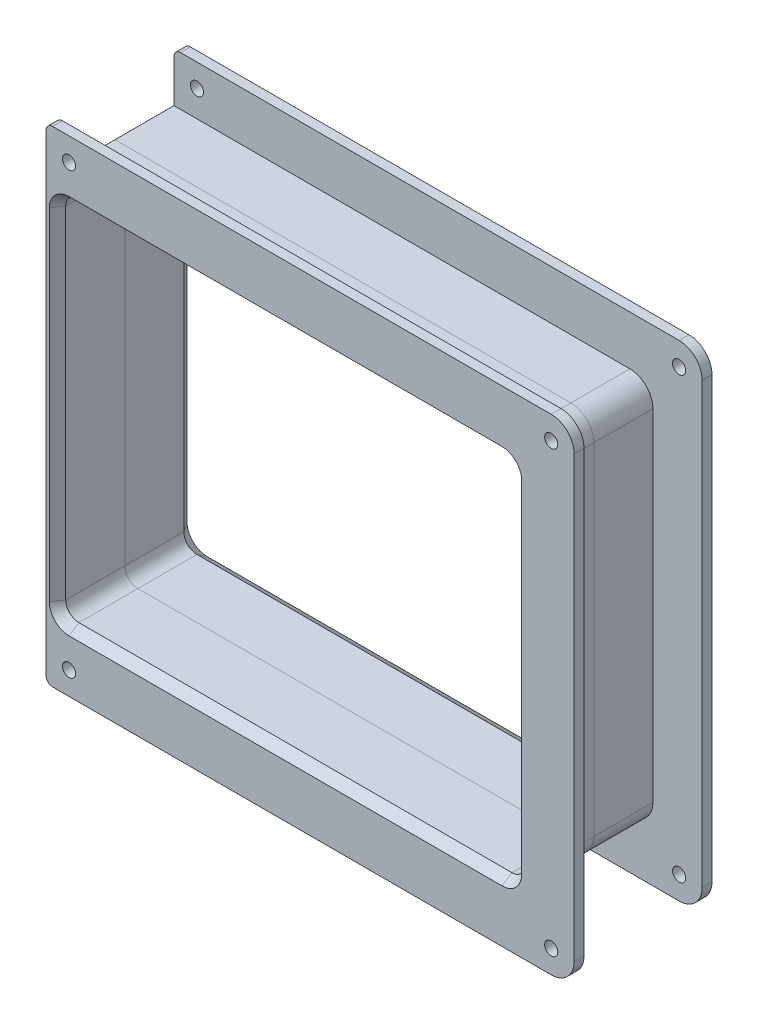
ISO-10303-21;
HEADER;
FILE_DESCRIPTION(('STEP AP214'),'2;1');
FILE_NAME('part.step','',(''),(''),'','','');
FILE_SCHEMA(('AUTOMOTIVE_DESIGN { 1 0 10303 214 1 1 1 1 }'));
ENDSEC;
DATA;
#1=APPLICATION_CONTEXT('core data for automotive mechanical design processes');
#2=APPLICATION_PROTOCOL_DEFINITION('international standard','automotive_design',2000,#1);
#3=PRODUCT_CONTEXT('',#1,'mechanical');
#4=PRODUCT('Part','Part','',(#3));
#5=PRODUCT_RELATED_PRODUCT_CATEGORY('part','',(#4));
#6=PRODUCT_DEFINITION_FORMATION('','',#4);
#7=PRODUCT_DEFINITION_CONTEXT('part definition',#1,'design');
#8=PRODUCT_DEFINITION('design','',#6,#7);
#9=PRODUCT_DEFINITION_SHAPE('','',#8);
#10=(LENGTH_UNIT() NAMED_UNIT(*) SI_UNIT(.MILLI.,.METRE.));
#11=(NAMED_UNIT(*) PLANE_ANGLE_UNIT() SI_UNIT($,.RADIAN.));
#12=(NAMED_UNIT(*) SI_UNIT($,.STERADIAN.) SOLID_ANGLE_UNIT());
#13=UNCERTAINTY_MEASURE_WITH_UNIT(LENGTH_MEASURE(1.E-05),#10,'distance_accuracy_value','');
#14=(GEOMETRIC_REPRESENTATION_CONTEXT(3) GLOBAL_UNCERTAINTY_ASSIGNED_CONTEXT((#13)) GLOBAL_UNIT_ASSIGNED_CONTEXT((#10,
#11,#12)) REPRESENTATION_CONTEXT('',''));
#15=CARTESIAN_POINT('',(0.,0.,0.));
#16=DIRECTION('',(0.,0.,1.));
#17=DIRECTION('',(1.,0.,0.));
#18=AXIS2_PLACEMENT_3D('',#15,#16,#17);
#19=CARTESIAN_POINT('',(146.,0.,42.));
#20=DIRECTION('',(1.,0.,0.));
#21=DIRECTION('',(0.,0.,1.));
#22=AXIS2_PLACEMENT_3D('',#19,#20,#21);
#23=PLANE('',#22);
#24=DIRECTION('',(0.,-1.,0.));
#25=VECTOR('',#24,1.);
#26=CARTESIAN_POINT('',(146.,0.,21.));
#27=LINE('',#26,#25);
#28=CARTESIAN_POINT('',(146.,111.,21.));
#29=VERTEX_POINT('',#28);
#30=CARTESIAN_POINT('',(146.,7.,21.));
#31=VERTEX_POINT('',#30);
#32=EDGE_CURVE('E244',#29,#31,#27,.T.);
#33=ORIENTED_EDGE('',*,*,#32,.F.);
#34=DIRECTION('',(0.,0.,1.));
#35=VECTOR('',#34,1.);
#36=CARTESIAN_POINT('',(146.,111.,42.));
#37=LINE('',#36,#35);
#38=CARTESIAN_POINT('',(146.,111.,39.));
#39=VERTEX_POINT('',#38);
#40=EDGE_CURVE('E338',#39,#29,#37,.F.);
#41=ORIENTED_EDGE('',*,*,#40,.F.);
#42=DIRECTION('',(0.,-1.,0.));
#43=VECTOR('',#42,1.);
#44=CARTESIAN_POINT('',(146.,118.,39.));
#45=LINE('',#44,#43);
#46=CARTESIAN_POINT('',(146.,7.00000000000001,39.));
#47=VERTEX_POINT('',#46);
#48=EDGE_CURVE('E421',#39,#47,#45,.T.);
#49=ORIENTED_EDGE('',*,*,#48,.T.);
#50=DIRECTION('',(0.,0.,1.));
#51=VECTOR('',#50,1.);
#52=CARTESIAN_POINT('',(146.,7.,39.));
#53=LINE('',#52,#51);
#54=EDGE_CURVE('E341',#31,#47,#53,.T.);
#55=ORIENTED_EDGE('',*,*,#54,.F.);
#56=EDGE_LOOP('',(#33,#41,#49,#55));
#57=FACE_BOUND('',#56,.T.);
#58=ADVANCED_FACE('F54',(#57),#23,.T.);
#59=CARTESIAN_POINT('',(146.,118.,-97.0381294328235));
#60=DIRECTION('',(0.,1.,0.));
#61=DIRECTION('',(0.,0.,-1.));
#62=AXIS2_PLACEMENT_3D('',#59,#60,#61);
#63=PLANE('',#62);
#64=DIRECTION('',(-1.,0.,0.));
#65=VECTOR('',#64,1.);
#66=CARTESIAN_POINT('',(146.,118.,21.));
#67=LINE('',#66,#65);
#68=CARTESIAN_POINT('',(139.,118.,21.));
#69=VERTEX_POINT('',#68);
#70=CARTESIAN_POINT('',(0.,118.,21.));
#71=VERTEX_POINT('',#70);
#72=EDGE_CURVE('E271',#69,#71,#67,.T.);
#73=ORIENTED_EDGE('',*,*,#72,.T.);
#74=DIRECTION('',(0.,0.,-1.));
#75=VECTOR('',#74,1.);
#76=CARTESIAN_POINT('',(0.,118.,42.));
#77=LINE('',#76,#75);
#78=CARTESIAN_POINT('',(0.,118.,39.));
#79=VERTEX_POINT('',#78);
#80=EDGE_CURVE('E252',#79,#71,#77,.T.);
#81=ORIENTED_EDGE('',*,*,#80,.F.);
#82=DIRECTION('',(-1.,0.,0.));
#83=VECTOR('',#82,1.);
#84=CARTESIAN_POINT('',(161.,118.,39.));
#85=LINE('',#84,#83);
#86=CARTESIAN_POINT('',(139.,118.,39.));
#87=VERTEX_POINT('',#86);
#88=EDGE_CURVE('E284',#87,#79,#85,.T.);
#89=ORIENTED_EDGE('',*,*,#88,.F.);
#90=DIRECTION('',(0.,0.,1.));
#91=VECTOR('',#90,1.);
#92=CARTESIAN_POINT('',(139.,118.,-97.0381294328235));
#93=LINE('',#92,#91);
#94=EDGE_CURVE('E349',#69,#87,#93,.T.);
#95=ORIENTED_EDGE('',*,*,#94,.F.);
#96=EDGE_LOOP('',(#73,#81,#89,#95));
#97=FACE_BOUND('',#96,.T.);
#98=ADVANCED_FACE('F494',(#97),#63,.T.);
#99=CARTESIAN_POINT('',(143.,118.,-97.0381294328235));
#100=DIRECTION('',(-1.,0.,0.));
#101=DIRECTION('',(0.,-1.,0.));
#102=AXIS2_PLACEMENT_3D('',#99,#100,#101);
#103=PLANE('',#102);
#104=DIRECTION('',(0.,0.,1.));
#105=VECTOR('',#104,1.);
#106=CARTESIAN_POINT('',(143.,111.,-97.0381294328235));
#107=LINE('',#106,#105);
#108=CARTESIAN_POINT('',(143.,111.,21.));
#109=VERTEX_POINT('',#108);
#110=CARTESIAN_POINT('',(143.,111.,39.));
#111=VERTEX_POINT('',#110);
#112=EDGE_CURVE('E301',#109,#111,#107,.T.);
#113=ORIENTED_EDGE('',*,*,#112,.F.);
#114=DIRECTION('',(0.,-1.,0.));
#115=VECTOR('',#114,1.);
#116=CARTESIAN_POINT('',(143.,118.,21.));
#117=LINE('',#116,#115);
#118=CARTESIAN_POINT('',(143.,7.00000000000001,21.));
#119=VERTEX_POINT('',#118);
#120=EDGE_CURVE('E268',#109,#119,#117,.T.);
#121=ORIENTED_EDGE('',*,*,#120,.T.);
#122=DIRECTION('',(0.,0.,1.));
#123=VECTOR('',#122,1.);
#124=CARTESIAN_POINT('',(143.,7.00000000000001,-97.0381294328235));
#125=LINE('',#124,#123);
#126=CARTESIAN_POINT('',(143.,7.00000000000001,39.));
#127=VERTEX_POINT('',#126);
#128=EDGE_CURVE('E304',#127,#119,#125,.F.);
#129=ORIENTED_EDGE('',*,*,#128,.F.);
#130=DIRECTION('',(0.,-1.,0.));
#131=VECTOR('',#130,1.);
#132=CARTESIAN_POINT('',(143.,7.00000000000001,39.));
#133=LINE('',#132,#131);
#134=EDGE_CURVE('E401',#111,#127,#133,.T.);
#135=ORIENTED_EDGE('',*,*,#134,.F.);
#136=EDGE_LOOP('',(#113,#121,#129,#135));
#137=FACE_BOUND('',#136,.T.);
#138=ADVANCED_FACE('F529',(#137),#103,.T.);
#139=CARTESIAN_POINT('',(146.,0.,42.));
#140=DIRECTION('',(0.,0.,-1.));
#141=DIRECTION('',(1.,0.,0.));
#142=AXIS2_PLACEMENT_3D('',#139,#140,#141);
#143=PLANE('',#142);
#144=CARTESIAN_POINT('',(7.00000000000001,111.,42.));
#145=DIRECTION('',(0.,0.,1.));
#146=DIRECTION('',(1.,0.,0.));
#147=AXIS2_PLACEMENT_3D('',#144,#145,#146);
#148=CIRCLE('',#147,6.00000000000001);
#149=CARTESIAN_POINT('',(7.00000000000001,117.,42.));
#150=VERTEX_POINT('',#149);
#151=CARTESIAN_POINT('',(1.,111.,42.));
#152=VERTEX_POINT('',#151);
#153=EDGE_CURVE('E371',#150,#152,#148,.T.);
#154=ORIENTED_EDGE('',*,*,#153,.F.);
#155=DIRECTION('',(-1.,0.,0.));
#156=VECTOR('',#155,1.);
#157=CARTESIAN_POINT('',(146.,117.,42.));
#158=LINE('',#157,#156);
#159=CARTESIAN_POINT('',(139.,117.,42.));
#160=VERTEX_POINT('',#159);
#161=EDGE_CURVE('E365',#160,#150,#158,.T.);
#162=ORIENTED_EDGE('',*,*,#161,.F.);
#163=CARTESIAN_POINT('',(139.,111.,42.));
#164=DIRECTION('',(0.,0.,1.));
#165=DIRECTION('',(1.,0.,0.));
#166=AXIS2_PLACEMENT_3D('',#163,#164,#165);
#167=CIRCLE('',#166,6.00000000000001);
#168=CARTESIAN_POINT('',(145.,111.,42.));
#169=VERTEX_POINT('',#168);
#170=EDGE_CURVE('E359',#169,#160,#167,.T.);
#171=ORIENTED_EDGE('',*,*,#170,.F.);
#172=DIRECTION('',(0.,1.,0.));
#173=VECTOR('',#172,1.);
#174=CARTESIAN_POINT('',(145.,111.,42.));
#175=LINE('',#174,#173);
#176=CARTESIAN_POINT('',(145.,7.00000000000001,42.));
#177=VERTEX_POINT('',#176);
#178=EDGE_CURVE('E356',#177,#169,#175,.T.);
#179=ORIENTED_EDGE('',*,*,#178,.F.);
#180=CARTESIAN_POINT('',(139.,7.,42.));
#181=DIRECTION('',(0.,0.,1.));
#182=DIRECTION('',(1.,0.,0.));
#183=AXIS2_PLACEMENT_3D('',#180,#181,#182);
#184=CIRCLE('',#183,6.00000000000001);
#185=CARTESIAN_POINT('',(139.,0.999999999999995,42.));
#186=VERTEX_POINT('',#185);
#187=EDGE_CURVE('E362',#186,#177,#184,.T.);
#188=ORIENTED_EDGE('',*,*,#187,.F.);
#189=DIRECTION('',(1.,0.,0.));
#190=VECTOR('',#189,1.);
#191=CARTESIAN_POINT('',(146.,1.,42.));
#192=LINE('',#191,#190);
#193=CARTESIAN_POINT('',(6.99999999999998,1.,42.));
#194=VERTEX_POINT('',#193);
#195=EDGE_CURVE('E368',#194,#186,#192,.T.);
#196=ORIENTED_EDGE('',*,*,#195,.F.);
#197=CARTESIAN_POINT('',(6.99999999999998,7.,42.));
#198=DIRECTION('',(0.,0.,1.));
#199=DIRECTION('',(1.,0.,0.));
#200=AXIS2_PLACEMENT_3D('',#197,#198,#199);
#201=CIRCLE('',#200,6.);
#202=CARTESIAN_POINT('',(0.999999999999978,7.00000000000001,42.));
#203=VERTEX_POINT('',#202);
#204=EDGE_CURVE('E374',#203,#194,#201,.T.);
#205=ORIENTED_EDGE('',*,*,#204,.F.);
#206=DIRECTION('',(0.,-1.,0.));
#207=VECTOR('',#206,1.);
#208=CARTESIAN_POINT('',(0.999999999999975,7.00000000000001,42.));
#209=LINE('',#208,#207);
#210=EDGE_CURVE('E377',#152,#203,#209,.T.);
#211=ORIENTED_EDGE('',*,*,#210,.F.);
#212=EDGE_LOOP('',(#154,#162,#171,#179,#188,#196,#205,#211));
#213=FACE_BOUND('',#212,.T.);
#214=DIRECTION('',(-1.,0.,0.));
#215=VECTOR('',#214,1.);
#216=CARTESIAN_POINT('',(161.,-15.,42.));
#217=LINE('',#216,#215);
#218=CARTESIAN_POINT('',(154.,-15.,42.));
#219=VERTEX_POINT('',#218);
#220=CARTESIAN_POINT('',(2.,-15.,42.));
#221=VERTEX_POINT('',#220);
#222=EDGE_CURVE('E259',#219,#221,#217,.T.);
#223=ORIENTED_EDGE('',*,*,#222,.F.);
#224=CARTESIAN_POINT('',(154.,-8.,42.));
#225=DIRECTION('',(0.,0.,1.));
#226=DIRECTION('',(1.,0.,0.));
#227=AXIS2_PLACEMENT_3D('',#224,#225,#226);
#228=CIRCLE('',#227,7.);
#229=CARTESIAN_POINT('',(161.,-8.,42.));
#230=VERTEX_POINT('',#229);
#231=EDGE_CURVE('E319',#230,#219,#228,.F.);
#232=ORIENTED_EDGE('',*,*,#231,.F.);
#233=DIRECTION('',(0.,-1.,0.));
#234=VECTOR('',#233,1.);
#235=CARTESIAN_POINT('',(161.,0.,42.));
#236=LINE('',#235,#234);
#237=CARTESIAN_POINT('',(161.,126.,42.));
#238=VERTEX_POINT('',#237);
#239=EDGE_CURVE('E256',#238,#230,#236,.T.);
#240=ORIENTED_EDGE('',*,*,#239,.F.);
#241=CARTESIAN_POINT('',(154.,126.,42.));
#242=DIRECTION('',(0.,0.,1.));
#243=DIRECTION('',(1.,0.,0.));
#244=AXIS2_PLACEMENT_3D('',#241,#242,#243);
#245=CIRCLE('',#244,7.);
#246=CARTESIAN_POINT('',(154.,133.,42.));
#247=VERTEX_POINT('',#246);
#248=EDGE_CURVE('E322',#247,#238,#245,.F.);
#249=ORIENTED_EDGE('',*,*,#248,.F.);
#250=DIRECTION('',(1.,0.,0.));
#251=VECTOR('',#250,1.);
#252=CARTESIAN_POINT('',(161.,133.,42.));
#253=LINE('',#252,#251);
#254=CARTESIAN_POINT('',(2.,133.,42.));
#255=VERTEX_POINT('',#254);
#256=EDGE_CURVE('E455',#255,#247,#253,.T.);
#257=ORIENTED_EDGE('',*,*,#256,.F.);
#258=CARTESIAN_POINT('',(2.,131.,42.));
#259=DIRECTION('',(0.,0.,1.));
#260=DIRECTION('',(1.,0.,0.));
#261=AXIS2_PLACEMENT_3D('',#258,#259,#260);
#262=CIRCLE('',#261,2.);
#263=CARTESIAN_POINT('',(0.,131.,42.));
#264=VERTEX_POINT('',#263);
#265=EDGE_CURVE('E423',#264,#255,#262,.F.);
#266=ORIENTED_EDGE('',*,*,#265,.F.);
#267=DIRECTION('',(0.,1.,0.));
#268=VECTOR('',#267,1.);
#269=CARTESIAN_POINT('',(0.,0.,42.));
#270=LINE('',#269,#268);
#271=CARTESIAN_POINT('',(0.,-13.,42.));
#272=VERTEX_POINT('',#271);
#273=EDGE_CURVE('E274',#272,#264,#270,.T.);
#274=ORIENTED_EDGE('',*,*,#273,.F.);
#275=CARTESIAN_POINT('',(2.,-13.,42.));
#276=DIRECTION('',(0.,0.,1.));
#277=DIRECTION('',(1.,0.,0.));
#278=AXIS2_PLACEMENT_3D('',#275,#276,#277);
#279=CIRCLE('',#278,2.);
#280=EDGE_CURVE('E425',#221,#272,#279,.F.);
#281=ORIENTED_EDGE('',*,*,#280,.F.);
#282=EDGE_LOOP('',(#223,#232,#240,#249,#257,#266,#274,#281));
#283=FACE_BOUND('',#282,.T.);
#284=CARTESIAN_POINT('',(7.00000000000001,-8.,42.));
#285=DIRECTION('',(0.,0.,-1.));
#286=DIRECTION('',(1.,0.,0.));
#287=AXIS2_PLACEMENT_3D('',#284,#285,#286);
#288=CIRCLE('',#287,2.);
#289=CARTESIAN_POINT('',(9.00000000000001,-8.,42.));
#290=VERTEX_POINT('',#289);
#291=EDGE_CURVE('E449',#290,#290,#288,.T.);
#292=ORIENTED_EDGE('',*,*,#291,.T.);
#293=EDGE_LOOP('',(#292));
#294=FACE_BOUND('',#293,.T.);
#295=CARTESIAN_POINT('',(154.,-8.,42.));
#296=DIRECTION('',(0.,0.,-1.));
#297=DIRECTION('',(-1.,0.,0.));
#298=AXIS2_PLACEMENT_3D('',#295,#296,#297);
#299=CIRCLE('',#298,2.);
#300=CARTESIAN_POINT('',(152.,-8.,42.));
#301=VERTEX_POINT('',#300);
#302=EDGE_CURVE('E443',#301,#301,#299,.T.);
#303=ORIENTED_EDGE('',*,*,#302,.T.);
#304=EDGE_LOOP('',(#303));
#305=FACE_BOUND('',#304,.T.);
#306=CARTESIAN_POINT('',(154.,126.,42.));
#307=DIRECTION('',(0.,0.,-1.));
#308=DIRECTION('',(1.,0.,0.));
#309=AXIS2_PLACEMENT_3D('',#306,#307,#308);
#310=CIRCLE('',#309,2.);
#311=CARTESIAN_POINT('',(156.,126.,42.));
#312=VERTEX_POINT('',#311);
#313=EDGE_CURVE('E471',#312,#312,#310,.T.);
#314=ORIENTED_EDGE('',*,*,#313,.T.);
#315=EDGE_LOOP('',(#314));
#316=FACE_BOUND('',#315,.T.);
#317=CARTESIAN_POINT('',(7.00000000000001,126.,42.));
#318=DIRECTION('',(0.,0.,-1.));
#319=DIRECTION('',(-1.,0.,0.));
#320=AXIS2_PLACEMENT_3D('',#317,#318,#319);
#321=CIRCLE('',#320,2.);
#322=CARTESIAN_POINT('',(5.00000000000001,126.,42.));
#323=VERTEX_POINT('',#322);
#324=EDGE_CURVE('E465',#323,#323,#321,.T.);
#325=ORIENTED_EDGE('',*,*,#324,.T.);
#326=EDGE_LOOP('',(#325));
#327=FACE_BOUND('',#326,.T.);
#328=ADVANCED_FACE('F501',(#213,#283,#294,#305,#316,#327),#143,.F.);
#329=CARTESIAN_POINT('',(146.,3.,42.));
#330=DIRECTION('',(0.,-1.,0.));
#331=DIRECTION('',(0.,0.,1.));
#332=AXIS2_PLACEMENT_3D('',#329,#330,#331);
#333=PLANE('',#332);
#334=DIRECTION('',(0.,0.,1.));
#335=VECTOR('',#334,1.);
#336=CARTESIAN_POINT('',(139.,3.,42.));
#337=LINE('',#336,#335);
#338=CARTESIAN_POINT('',(139.,3.,21.));
#339=VERTEX_POINT('',#338);
#340=CARTESIAN_POINT('',(139.,3.,39.));
#341=VERTEX_POINT('',#340);
#342=EDGE_CURVE('E295',#339,#341,#337,.T.);
#343=ORIENTED_EDGE('',*,*,#342,.F.);
#344=DIRECTION('',(-1.,0.,0.));
#345=VECTOR('',#344,1.);
#346=CARTESIAN_POINT('',(146.,3.,21.));
#347=LINE('',#346,#345);
#348=CARTESIAN_POINT('',(6.99999999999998,3.,21.));
#349=VERTEX_POINT('',#348);
#350=EDGE_CURVE('E281',#339,#349,#347,.T.);
#351=ORIENTED_EDGE('',*,*,#350,.T.);
#352=DIRECTION('',(0.,0.,-1.));
#353=VECTOR('',#352,1.);
#354=CARTESIAN_POINT('',(6.99999999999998,3.,42.));
#355=LINE('',#354,#353);
#356=CARTESIAN_POINT('',(6.99999999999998,3.,39.));
#357=VERTEX_POINT('',#356);
#358=EDGE_CURVE('E298',#357,#349,#355,.T.);
#359=ORIENTED_EDGE('',*,*,#358,.F.);
#360=DIRECTION('',(-1.,0.,0.));
#361=VECTOR('',#360,1.);
#362=CARTESIAN_POINT('',(146.,3.,39.));
#363=LINE('',#362,#361);
#364=EDGE_CURVE('E389',#341,#357,#363,.T.);
#365=ORIENTED_EDGE('',*,*,#364,.F.);
#366=EDGE_LOOP('',(#343,#351,#359,#365));
#367=FACE_BOUND('',#366,.T.);
#368=ADVANCED_FACE('F540',(#367),#333,.F.);
#369=CARTESIAN_POINT('',(146.,0.,21.));
#370=DIRECTION('',(0.,0.,1.));
#371=DIRECTION('',(-1.,0.,0.));
#372=AXIS2_PLACEMENT_3D('',#369,#370,#371);
#373=PLANE('',#372);
#374=ORIENTED_EDGE('',*,*,#120,.F.);
#375=CARTESIAN_POINT('',(139.,111.,21.));
#376=DIRECTION('',(0.,0.,-1.));
#377=DIRECTION('',(-1.,0.,0.));
#378=AXIS2_PLACEMENT_3D('',#375,#376,#377);
#379=CIRCLE('',#378,4.);
#380=CARTESIAN_POINT('',(139.,115.,21.));
#381=VERTEX_POINT('',#380);
#382=EDGE_CURVE('E315',#381,#109,#379,.T.);
#383=ORIENTED_EDGE('',*,*,#382,.F.);
#384=DIRECTION('',(-1.,0.,0.));
#385=VECTOR('',#384,1.);
#386=CARTESIAN_POINT('',(146.,115.,21.));
#387=LINE('',#386,#385);
#388=CARTESIAN_POINT('',(7.00000000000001,115.,21.));
#389=VERTEX_POINT('',#388);
#390=EDGE_CURVE('E265',#381,#389,#387,.T.);
#391=ORIENTED_EDGE('',*,*,#390,.T.);
#392=CARTESIAN_POINT('',(7.00000000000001,111.,21.));
#393=DIRECTION('',(0.,0.,-1.));
#394=DIRECTION('',(-1.,0.,0.));
#395=AXIS2_PLACEMENT_3D('',#392,#393,#394);
#396=CIRCLE('',#395,4.);
#397=CARTESIAN_POINT('',(3.,111.,21.));
#398=VERTEX_POINT('',#397);
#399=EDGE_CURVE('E307',#398,#389,#396,.T.);
#400=ORIENTED_EDGE('',*,*,#399,.F.);
#401=DIRECTION('',(0.,1.,0.));
#402=VECTOR('',#401,1.);
#403=CARTESIAN_POINT('',(3.,118.,21.));
#404=LINE('',#403,#402);
#405=CARTESIAN_POINT('',(2.99999999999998,7.00000000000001,21.));
#406=VERTEX_POINT('',#405);
#407=EDGE_CURVE('E249',#406,#398,#404,.T.);
#408=ORIENTED_EDGE('',*,*,#407,.F.);
#409=CARTESIAN_POINT('',(6.99999999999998,7.,21.));
#410=DIRECTION('',(0.,0.,-1.));
#411=DIRECTION('',(-1.,0.,0.));
#412=AXIS2_PLACEMENT_3D('',#409,#410,#411);
#413=CIRCLE('',#412,4.);
#414=EDGE_CURVE('E310',#349,#406,#413,.T.);
#415=ORIENTED_EDGE('',*,*,#414,.F.);
#416=ORIENTED_EDGE('',*,*,#350,.F.);
#417=CARTESIAN_POINT('',(139.,7.,21.));
#418=DIRECTION('',(0.,0.,-1.));
#419=DIRECTION('',(-1.,0.,0.));
#420=AXIS2_PLACEMENT_3D('',#417,#418,#419);
#421=CIRCLE('',#420,4.);
#422=EDGE_CURVE('E313',#119,#339,#421,.T.);
#423=ORIENTED_EDGE('',*,*,#422,.F.);
#424=EDGE_LOOP('',(#374,#383,#391,#400,#408,#415,#416,#423));
#425=FACE_BOUND('',#424,.T.);
#426=DIRECTION('',(-1.,0.,0.));
#427=VECTOR('',#426,1.);
#428=CARTESIAN_POINT('',(146.,0.,21.));
#429=LINE('',#428,#427);
#430=CARTESIAN_POINT('',(139.,0.,21.));
#431=VERTEX_POINT('',#430);
#432=CARTESIAN_POINT('',(0.,0.,21.));
#433=VERTEX_POINT('',#432);
#434=EDGE_CURVE('E277',#431,#433,#429,.T.);
#435=ORIENTED_EDGE('',*,*,#434,.T.);
#436=DIRECTION('',(0.,-1.,0.));
#437=VECTOR('',#436,1.);
#438=CARTESIAN_POINT('',(0.,0.,21.));
#439=LINE('',#438,#437);
#440=EDGE_CURVE('E240',#71,#433,#439,.T.);
#441=ORIENTED_EDGE('',*,*,#440,.F.);
#442=ORIENTED_EDGE('',*,*,#72,.F.);
#443=CARTESIAN_POINT('',(139.,111.,21.));
#444=DIRECTION('',(0.,0.,-1.));
#445=DIRECTION('',(-1.,0.,0.));
#446=AXIS2_PLACEMENT_3D('',#443,#444,#445);
#447=CIRCLE('',#446,7.);
#448=EDGE_CURVE('E345',#29,#69,#447,.F.);
#449=ORIENTED_EDGE('',*,*,#448,.F.);
#450=ORIENTED_EDGE('',*,*,#32,.T.);
#451=CARTESIAN_POINT('',(139.,7.,21.));
#452=DIRECTION('',(0.,0.,-1.));
#453=DIRECTION('',(-1.,0.,0.));
#454=AXIS2_PLACEMENT_3D('',#451,#452,#453);
#455=CIRCLE('',#454,7.);
#456=EDGE_CURVE('E347',#431,#31,#455,.F.);
#457=ORIENTED_EDGE('',*,*,#456,.F.);
#458=EDGE_LOOP('',(#435,#441,#442,#449,#450,#457));
#459=FACE_BOUND('',#458,.T.);
#460=ADVANCED_FACE('F486',(#425,#459),#373,.F.);
#461=CARTESIAN_POINT('',(146.,0.,42.));
#462=DIRECTION('',(0.,1.,0.));
#463=DIRECTION('',(0.,0.,-1.));
#464=AXIS2_PLACEMENT_3D('',#461,#462,#463);
#465=PLANE('',#464);
#466=DIRECTION('',(1.,0.,0.));
#467=VECTOR('',#466,1.);
#468=CARTESIAN_POINT('',(161.,0.,39.));
#469=LINE('',#468,#467);
#470=CARTESIAN_POINT('',(0.,0.,39.));
#471=VERTEX_POINT('',#470);
#472=CARTESIAN_POINT('',(139.,0.,39.));
#473=VERTEX_POINT('',#472);
#474=EDGE_CURVE('E229',#471,#473,#469,.T.);
#475=ORIENTED_EDGE('',*,*,#474,.F.);
#476=DIRECTION('',(0.,0.,1.));
#477=VECTOR('',#476,1.);
#478=CARTESIAN_POINT('',(0.,0.,42.));
#479=LINE('',#478,#477);
#480=EDGE_CURVE('E236',#433,#471,#479,.T.);
#481=ORIENTED_EDGE('',*,*,#480,.F.);
#482=ORIENTED_EDGE('',*,*,#434,.F.);
#483=DIRECTION('',(0.,0.,1.));
#484=VECTOR('',#483,1.);
#485=CARTESIAN_POINT('',(139.,0.,21.));
#486=LINE('',#485,#484);
#487=EDGE_CURVE('E248',#473,#431,#486,.F.);
#488=ORIENTED_EDGE('',*,*,#487,.F.);
#489=EDGE_LOOP('',(#475,#481,#482,#488));
#490=FACE_BOUND('',#489,.T.);
#491=ADVANCED_FACE('F247',(#490),#465,.F.);
#492=CARTESIAN_POINT('',(0.,0.,42.));
#493=DIRECTION('',(1.,0.,0.));
#494=DIRECTION('',(0.,0.,1.));
#495=AXIS2_PLACEMENT_3D('',#492,#493,#494);
#496=PLANE('',#495);
#497=ORIENTED_EDGE('',*,*,#273,.T.);
#498=DIRECTION('',(0.,0.,1.));
#499=VECTOR('',#498,1.);
#500=CARTESIAN_POINT('',(0.,131.,42.));
#501=LINE('',#500,#499);
#502=CARTESIAN_POINT('',(0.,131.,39.));
#503=VERTEX_POINT('',#502);
#504=EDGE_CURVE('E428',#503,#264,#501,.T.);
#505=ORIENTED_EDGE('',*,*,#504,.F.);
#506=DIRECTION('',(0.,1.,0.));
#507=VECTOR('',#506,1.);
#508=CARTESIAN_POINT('',(0.,118.,39.));
#509=LINE('',#508,#507);
#510=EDGE_CURVE('E458',#79,#503,#509,.T.);
#511=ORIENTED_EDGE('',*,*,#510,.F.);
#512=ORIENTED_EDGE('',*,*,#80,.T.);
#513=ORIENTED_EDGE('',*,*,#440,.T.);
#514=ORIENTED_EDGE('',*,*,#480,.T.);
#515=DIRECTION('',(0.,1.,0.));
#516=VECTOR('',#515,1.);
#517=CARTESIAN_POINT('',(0.,0.,39.));
#518=LINE('',#517,#516);
#519=CARTESIAN_POINT('',(0.,-13.,39.));
#520=VERTEX_POINT('',#519);
#521=EDGE_CURVE('E224',#520,#471,#518,.T.);
#522=ORIENTED_EDGE('',*,*,#521,.F.);
#523=DIRECTION('',(0.,0.,1.));
#524=VECTOR('',#523,1.);
#525=CARTESIAN_POINT('',(0.,-13.,39.));
#526=LINE('',#525,#524);
#527=EDGE_CURVE('E430',#272,#520,#526,.F.);
#528=ORIENTED_EDGE('',*,*,#527,.F.);
#529=EDGE_LOOP('',(#497,#505,#511,#512,#513,#514,#522,#528));
#530=FACE_BOUND('',#529,.T.);
#531=ADVANCED_FACE('F238',(#530),#496,.F.);
#532=CARTESIAN_POINT('',(146.,115.,42.));
#533=DIRECTION('',(0.,1.,0.));
#534=DIRECTION('',(0.,0.,-1.));
#535=AXIS2_PLACEMENT_3D('',#532,#533,#534);
#536=PLANE('',#535);
#537=DIRECTION('',(0.,0.,1.));
#538=VECTOR('',#537,1.);
#539=CARTESIAN_POINT('',(7.00000000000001,115.,42.));
#540=LINE('',#539,#538);
#541=CARTESIAN_POINT('',(7.00000000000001,115.,39.));
#542=VERTEX_POINT('',#541);
#543=EDGE_CURVE('E287',#389,#542,#540,.T.);
#544=ORIENTED_EDGE('',*,*,#543,.F.);
#545=ORIENTED_EDGE('',*,*,#390,.F.);
#546=DIRECTION('',(0.,0.,1.));
#547=VECTOR('',#546,1.);
#548=CARTESIAN_POINT('',(139.,115.,42.));
#549=LINE('',#548,#547);
#550=CARTESIAN_POINT('',(139.,115.,39.));
#551=VERTEX_POINT('',#550);
#552=EDGE_CURVE('E285',#551,#381,#549,.F.);
#553=ORIENTED_EDGE('',*,*,#552,.F.);
#554=DIRECTION('',(1.,0.,0.));
#555=VECTOR('',#554,1.);
#556=CARTESIAN_POINT('',(146.,115.,39.));
#557=LINE('',#556,#555);
#558=EDGE_CURVE('E392',#542,#551,#557,.T.);
#559=ORIENTED_EDGE('',*,*,#558,.F.);
#560=EDGE_LOOP('',(#544,#545,#553,#559));
#561=FACE_BOUND('',#560,.T.);
#562=ADVANCED_FACE('F535',(#561),#536,.F.);
#563=CARTESIAN_POINT('',(3.,118.,-97.0381294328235));
#564=DIRECTION('',(1.,0.,0.));
#565=DIRECTION('',(0.,1.,0.));
#566=AXIS2_PLACEMENT_3D('',#563,#564,#565);
#567=PLANE('',#566);
#568=DIRECTION('',(0.,0.,-1.));
#569=VECTOR('',#568,1.);
#570=CARTESIAN_POINT('',(2.99999999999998,7.00000000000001,-97.0381294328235));
#571=LINE('',#570,#569);
#572=CARTESIAN_POINT('',(2.99999999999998,7.00000000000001,39.));
#573=VERTEX_POINT('',#572);
#574=EDGE_CURVE('E290',#406,#573,#571,.F.);
#575=ORIENTED_EDGE('',*,*,#574,.F.);
#576=ORIENTED_EDGE('',*,*,#407,.T.);
#577=DIRECTION('',(0.,0.,1.));
#578=VECTOR('',#577,1.);
#579=CARTESIAN_POINT('',(3.,111.,-97.0381294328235));
#580=LINE('',#579,#578);
#581=CARTESIAN_POINT('',(3.,111.,39.));
#582=VERTEX_POINT('',#581);
#583=EDGE_CURVE('E293',#582,#398,#580,.F.);
#584=ORIENTED_EDGE('',*,*,#583,.F.);
#585=DIRECTION('',(0.,1.,0.));
#586=VECTOR('',#585,1.);
#587=CARTESIAN_POINT('',(3.,111.,39.));
#588=LINE('',#587,#586);
#589=EDGE_CURVE('E380',#573,#582,#588,.T.);
#590=ORIENTED_EDGE('',*,*,#589,.F.);
#591=EDGE_LOOP('',(#575,#576,#584,#590));
#592=FACE_BOUND('',#591,.T.);
#593=ADVANCED_FACE('F592',(#592),#567,.T.);
#594=CARTESIAN_POINT('',(161.,0.,39.));
#595=DIRECTION('',(1.,0.,0.));
#596=DIRECTION('',(0.,0.,1.));
#597=AXIS2_PLACEMENT_3D('',#594,#595,#596);
#598=PLANE('',#597);
#599=ORIENTED_EDGE('',*,*,#239,.T.);
#600=DIRECTION('',(0.,0.,1.));
#601=VECTOR('',#600,1.);
#602=CARTESIAN_POINT('',(161.,-8.,39.));
#603=LINE('',#602,#601);
#604=CARTESIAN_POINT('',(161.,-8.,39.));
#605=VERTEX_POINT('',#604);
#606=EDGE_CURVE('E325',#605,#230,#603,.T.);
#607=ORIENTED_EDGE('',*,*,#606,.F.);
#608=DIRECTION('',(0.,-1.,0.));
#609=VECTOR('',#608,1.);
#610=CARTESIAN_POINT('',(161.,0.,39.));
#611=LINE('',#610,#609);
#612=CARTESIAN_POINT('',(161.,126.,39.));
#613=VERTEX_POINT('',#612);
#614=EDGE_CURVE('E262',#613,#605,#611,.T.);
#615=ORIENTED_EDGE('',*,*,#614,.F.);
#616=DIRECTION('',(0.,0.,1.));
#617=VECTOR('',#616,1.);
#618=CARTESIAN_POINT('',(161.,126.,39.));
#619=LINE('',#618,#617);
#620=EDGE_CURVE('E327',#238,#613,#619,.F.);
#621=ORIENTED_EDGE('',*,*,#620,.F.);
#622=EDGE_LOOP('',(#599,#607,#615,#621));
#623=FACE_BOUND('',#622,.T.);
#624=ADVANCED_FACE('F511',(#623),#598,.T.);
#625=CARTESIAN_POINT('',(161.,-15.,39.));
#626=DIRECTION('',(0.,-1.,0.));
#627=DIRECTION('',(0.,0.,1.));
#628=AXIS2_PLACEMENT_3D('',#625,#626,#627);
#629=PLANE('',#628);
#630=DIRECTION('',(-1.,0.,0.));
#631=VECTOR('',#630,1.);
#632=CARTESIAN_POINT('',(161.,-15.,39.));
#633=LINE('',#632,#631);
#634=CARTESIAN_POINT('',(154.,-15.,39.));
#635=VERTEX_POINT('',#634);
#636=CARTESIAN_POINT('',(2.,-15.,39.));
#637=VERTEX_POINT('',#636);
#638=EDGE_CURVE('E233',#635,#637,#633,.T.);
#639=ORIENTED_EDGE('',*,*,#638,.F.);
#640=DIRECTION('',(0.,0.,1.));
#641=VECTOR('',#640,1.);
#642=CARTESIAN_POINT('',(154.,-15.,39.));
#643=LINE('',#642,#641);
#644=EDGE_CURVE('E335',#219,#635,#643,.F.);
#645=ORIENTED_EDGE('',*,*,#644,.F.);
#646=ORIENTED_EDGE('',*,*,#222,.T.);
#647=DIRECTION('',(0.,0.,1.));
#648=VECTOR('',#647,1.);
#649=CARTESIAN_POINT('',(2.,-15.,42.));
#650=LINE('',#649,#648);
#651=EDGE_CURVE('E404',#637,#221,#650,.T.);
#652=ORIENTED_EDGE('',*,*,#651,.F.);
#653=EDGE_LOOP('',(#639,#645,#646,#652));
#654=FACE_BOUND('',#653,.T.);
#655=ADVANCED_FACE('F438',(#654),#629,.T.);
#656=CARTESIAN_POINT('',(0.,0.,39.));
#657=DIRECTION('',(0.,0.,1.));
#658=DIRECTION('',(-1.,0.,0.));
#659=AXIS2_PLACEMENT_3D('',#656,#657,#658);
#660=PLANE('',#659);
#661=CARTESIAN_POINT('',(7.00000000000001,-8.,39.));
#662=DIRECTION('',(0.,0.,-1.));
#663=DIRECTION('',(1.,0.,0.));
#664=AXIS2_PLACEMENT_3D('',#661,#662,#663);
#665=CIRCLE('',#664,2.);
#666=CARTESIAN_POINT('',(9.00000000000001,-8.,39.));
#667=VERTEX_POINT('',#666);
#668=EDGE_CURVE('E446',#667,#667,#665,.T.);
#669=ORIENTED_EDGE('',*,*,#668,.F.);
#670=EDGE_LOOP('',(#669));
#671=FACE_BOUND('',#670,.T.);
#672=CARTESIAN_POINT('',(154.,-8.,39.));
#673=DIRECTION('',(0.,0.,-1.));
#674=DIRECTION('',(-1.,0.,0.));
#675=AXIS2_PLACEMENT_3D('',#672,#673,#674);
#676=CIRCLE('',#675,2.);
#677=CARTESIAN_POINT('',(152.,-8.,39.));
#678=VERTEX_POINT('',#677);
#679=EDGE_CURVE('E260',#678,#678,#676,.T.);
#680=ORIENTED_EDGE('',*,*,#679,.F.);
#681=EDGE_LOOP('',(#680));
#682=FACE_BOUND('',#681,.T.);
#683=ORIENTED_EDGE('',*,*,#521,.T.);
#684=ORIENTED_EDGE('',*,*,#474,.T.);
#685=CARTESIAN_POINT('',(139.,7.,39.));
#686=DIRECTION('',(0.,0.,-1.));
#687=DIRECTION('',(-1.,0.,0.));
#688=AXIS2_PLACEMENT_3D('',#685,#686,#687);
#689=CIRCLE('',#688,7.);
#690=EDGE_CURVE('E352',#47,#473,#689,.T.);
#691=ORIENTED_EDGE('',*,*,#690,.F.);
#692=ORIENTED_EDGE('',*,*,#48,.F.);
#693=CARTESIAN_POINT('',(139.,111.,39.));
#694=DIRECTION('',(0.,0.,-1.));
#695=DIRECTION('',(-1.,0.,0.));
#696=AXIS2_PLACEMENT_3D('',#693,#694,#695);
#697=CIRCLE('',#696,7.);
#698=EDGE_CURVE('E354',#87,#39,#697,.T.);
#699=ORIENTED_EDGE('',*,*,#698,.F.);
#700=ORIENTED_EDGE('',*,*,#88,.T.);
#701=ORIENTED_EDGE('',*,*,#510,.T.);
#702=CARTESIAN_POINT('',(2.,131.,39.));
#703=DIRECTION('',(0.,0.,-1.));
#704=DIRECTION('',(-1.,0.,0.));
#705=AXIS2_PLACEMENT_3D('',#702,#703,#704);
#706=CIRCLE('',#705,2.);
#707=CARTESIAN_POINT('',(2.,133.,39.));
#708=VERTEX_POINT('',#707);
#709=EDGE_CURVE('E72',#708,#503,#706,.F.);
#710=ORIENTED_EDGE('',*,*,#709,.F.);
#711=DIRECTION('',(1.,0.,0.));
#712=VECTOR('',#711,1.);
#713=CARTESIAN_POINT('',(161.,133.,39.));
#714=LINE('',#713,#712);
#715=CARTESIAN_POINT('',(154.,133.,39.));
#716=VERTEX_POINT('',#715);
#717=EDGE_CURVE('E452',#708,#716,#714,.T.);
#718=ORIENTED_EDGE('',*,*,#717,.T.);
#719=CARTESIAN_POINT('',(154.,126.,39.));
#720=DIRECTION('',(0.,0.,-1.));
#721=DIRECTION('',(-1.,0.,0.));
#722=AXIS2_PLACEMENT_3D('',#719,#720,#721);
#723=CIRCLE('',#722,7.);
#724=EDGE_CURVE('E332',#613,#716,#723,.F.);
#725=ORIENTED_EDGE('',*,*,#724,.F.);
#726=ORIENTED_EDGE('',*,*,#614,.T.);
#727=CARTESIAN_POINT('',(154.,-8.,39.));
#728=DIRECTION('',(0.,0.,-1.));
#729=DIRECTION('',(-1.,0.,0.));
#730=AXIS2_PLACEMENT_3D('',#727,#728,#729);
#731=CIRCLE('',#730,7.);
#732=EDGE_CURVE('E330',#635,#605,#731,.F.);
#733=ORIENTED_EDGE('',*,*,#732,.F.);
#734=ORIENTED_EDGE('',*,*,#638,.T.);
#735=CARTESIAN_POINT('',(2.,-13.,39.));
#736=DIRECTION('',(0.,0.,-1.));
#737=DIRECTION('',(-1.,0.,0.));
#738=AXIS2_PLACEMENT_3D('',#735,#736,#737);
#739=CIRCLE('',#738,2.);
#740=EDGE_CURVE('E62',#520,#637,#739,.F.);
#741=ORIENTED_EDGE('',*,*,#740,.F.);
#742=EDGE_LOOP('',(#683,#684,#691,#692,#699,#700,#701,#710,#718,#725,#726,#733,#734,#741));
#743=FACE_BOUND('',#742,.T.);
#744=CARTESIAN_POINT('',(154.,126.,39.));
#745=DIRECTION('',(0.,0.,-1.));
#746=DIRECTION('',(1.,0.,0.));
#747=AXIS2_PLACEMENT_3D('',#744,#745,#746);
#748=CIRCLE('',#747,2.);
#749=CARTESIAN_POINT('',(156.,126.,39.));
#750=VERTEX_POINT('',#749);
#751=EDGE_CURVE('E468',#750,#750,#748,.T.);
#752=ORIENTED_EDGE('',*,*,#751,.F.);
#753=EDGE_LOOP('',(#752));
#754=FACE_BOUND('',#753,.T.);
#755=CARTESIAN_POINT('',(7.00000000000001,126.,39.));
#756=DIRECTION('',(0.,0.,-1.));
#757=DIRECTION('',(-1.,0.,0.));
#758=AXIS2_PLACEMENT_3D('',#755,#756,#757);
#759=CIRCLE('',#758,2.);
#760=CARTESIAN_POINT('',(5.00000000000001,126.,39.));
#761=VERTEX_POINT('',#760);
#762=EDGE_CURVE('E459',#761,#761,#759,.T.);
#763=ORIENTED_EDGE('',*,*,#762,.F.);
#764=EDGE_LOOP('',(#763));
#765=FACE_BOUND('',#764,.T.);
#766=ADVANCED_FACE('F226',(#671,#682,#743,#754,#765),#660,.F.);
#767=CARTESIAN_POINT('',(154.,-8.,39.));
#768=DIRECTION('',(0.,0.,1.));
#769=DIRECTION('',(-1.,0.,0.));
#770=AXIS2_PLACEMENT_3D('',#767,#768,#769);
#771=CYLINDRICAL_SURFACE('',#770,2.);
#772=ORIENTED_EDGE('',*,*,#679,.T.);
#773=EDGE_LOOP('',(#772));
#774=FACE_BOUND('',#773,.T.);
#775=ORIENTED_EDGE('',*,*,#302,.F.);
#776=EDGE_LOOP('',(#775));
#777=FACE_BOUND('',#776,.T.);
#778=ADVANCED_FACE('F772',(#774,#777),#771,.F.);
#779=CARTESIAN_POINT('',(7.00000000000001,-8.,39.));
#780=DIRECTION('',(0.,0.,1.));
#781=DIRECTION('',(-1.,0.,0.));
#782=AXIS2_PLACEMENT_3D('',#779,#780,#781);
#783=CYLINDRICAL_SURFACE('',#782,2.);
#784=ORIENTED_EDGE('',*,*,#668,.T.);
#785=EDGE_LOOP('',(#784));
#786=FACE_BOUND('',#785,.T.);
#787=ORIENTED_EDGE('',*,*,#291,.F.);
#788=EDGE_LOOP('',(#787));
#789=FACE_BOUND('',#788,.T.);
#790=ADVANCED_FACE('F764',(#786,#789),#783,.F.);
#791=CARTESIAN_POINT('',(161.,133.,39.));
#792=DIRECTION('',(0.,1.,0.));
#793=DIRECTION('',(0.,0.,-1.));
#794=AXIS2_PLACEMENT_3D('',#791,#792,#793);
#795=PLANE('',#794);
#796=ORIENTED_EDGE('',*,*,#256,.T.);
#797=DIRECTION('',(0.,0.,1.));
#798=VECTOR('',#797,1.);
#799=CARTESIAN_POINT('',(154.,133.,39.));
#800=LINE('',#799,#798);
#801=EDGE_CURVE('E317',#716,#247,#800,.T.);
#802=ORIENTED_EDGE('',*,*,#801,.F.);
#803=ORIENTED_EDGE('',*,*,#717,.F.);
#804=DIRECTION('',(0.,0.,1.));
#805=VECTOR('',#804,1.);
#806=CARTESIAN_POINT('',(2.,133.,39.));
#807=LINE('',#806,#805);
#808=EDGE_CURVE('E14',#255,#708,#807,.F.);
#809=ORIENTED_EDGE('',*,*,#808,.F.);
#810=EDGE_LOOP('',(#796,#802,#803,#809));
#811=FACE_BOUND('',#810,.T.);
#812=ADVANCED_FACE('F505',(#811),#795,.T.);
#813=CARTESIAN_POINT('',(7.00000000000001,126.,39.));
#814=DIRECTION('',(0.,0.,1.));
#815=DIRECTION('',(-1.,0.,0.));
#816=AXIS2_PLACEMENT_3D('',#813,#814,#815);
#817=CYLINDRICAL_SURFACE('',#816,2.);
#818=ORIENTED_EDGE('',*,*,#762,.T.);
#819=EDGE_LOOP('',(#818));
#820=FACE_BOUND('',#819,.T.);
#821=ORIENTED_EDGE('',*,*,#324,.F.);
#822=EDGE_LOOP('',(#821));
#823=FACE_BOUND('',#822,.T.);
#824=ADVANCED_FACE('F747',(#820,#823),#817,.F.);
#825=CARTESIAN_POINT('',(154.,126.,39.));
#826=DIRECTION('',(0.,0.,1.));
#827=DIRECTION('',(-1.,0.,0.));
#828=AXIS2_PLACEMENT_3D('',#825,#826,#827);
#829=CYLINDRICAL_SURFACE('',#828,2.);
#830=ORIENTED_EDGE('',*,*,#751,.T.);
#831=EDGE_LOOP('',(#830));
#832=FACE_BOUND('',#831,.T.);
#833=ORIENTED_EDGE('',*,*,#313,.F.);
#834=EDGE_LOOP('',(#833));
#835=FACE_BOUND('',#834,.T.);
#836=ADVANCED_FACE('F552',(#832,#835),#829,.F.);
#837=CARTESIAN_POINT('',(7.00000000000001,111.,42.));
#838=DIRECTION('',(0.,0.,1.));
#839=DIRECTION('',(-1.,0.,0.));
#840=AXIS2_PLACEMENT_3D('',#837,#838,#839);
#841=CYLINDRICAL_SURFACE('',#840,4.);
#842=ORIENTED_EDGE('',*,*,#583,.T.);
#843=ORIENTED_EDGE('',*,*,#399,.T.);
#844=ORIENTED_EDGE('',*,*,#543,.T.);
#845=CARTESIAN_POINT('',(7.00000000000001,111.,39.));
#846=DIRECTION('',(0.,0.,1.));
#847=DIRECTION('',(1.,0.,0.));
#848=AXIS2_PLACEMENT_3D('',#845,#846,#847);
#849=CIRCLE('',#848,4.);
#850=EDGE_CURVE('E386',#582,#542,#849,.F.);
#851=ORIENTED_EDGE('',*,*,#850,.F.);
#852=EDGE_LOOP('',(#842,#843,#844,#851));
#853=FACE_BOUND('',#852,.T.);
#854=ADVANCED_FACE('F548',(#853),#841,.F.);
#855=CARTESIAN_POINT('',(6.99999999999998,7.,42.));
#856=DIRECTION('',(0.,0.,-1.));
#857=DIRECTION('',(1.,0.,0.));
#858=AXIS2_PLACEMENT_3D('',#855,#856,#857);
#859=CYLINDRICAL_SURFACE('',#858,4.);
#860=ORIENTED_EDGE('',*,*,#358,.T.);
#861=ORIENTED_EDGE('',*,*,#414,.T.);
#862=ORIENTED_EDGE('',*,*,#574,.T.);
#863=CARTESIAN_POINT('',(6.99999999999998,7.,39.));
#864=DIRECTION('',(0.,0.,1.));
#865=DIRECTION('',(1.,0.,0.));
#866=AXIS2_PLACEMENT_3D('',#863,#864,#865);
#867=CIRCLE('',#866,4.);
#868=EDGE_CURVE('E383',#357,#573,#867,.F.);
#869=ORIENTED_EDGE('',*,*,#868,.F.);
#870=EDGE_LOOP('',(#860,#861,#862,#869));
#871=FACE_BOUND('',#870,.T.);
#872=ADVANCED_FACE('F551',(#871),#859,.F.);
#873=CARTESIAN_POINT('',(139.,7.,42.));
#874=DIRECTION('',(0.,0.,1.));
#875=DIRECTION('',(-1.,0.,0.));
#876=AXIS2_PLACEMENT_3D('',#873,#874,#875);
#877=CYLINDRICAL_SURFACE('',#876,4.);
#878=ORIENTED_EDGE('',*,*,#128,.T.);
#879=ORIENTED_EDGE('',*,*,#422,.T.);
#880=ORIENTED_EDGE('',*,*,#342,.T.);
#881=CARTESIAN_POINT('',(139.,7.,39.));
#882=DIRECTION('',(0.,0.,1.));
#883=DIRECTION('',(1.,0.,0.));
#884=AXIS2_PLACEMENT_3D('',#881,#882,#883);
#885=CIRCLE('',#884,4.);
#886=EDGE_CURVE('E395',#127,#341,#885,.F.);
#887=ORIENTED_EDGE('',*,*,#886,.F.);
#888=EDGE_LOOP('',(#878,#879,#880,#887));
#889=FACE_BOUND('',#888,.T.);
#890=ADVANCED_FACE('F556',(#889),#877,.F.);
#891=CARTESIAN_POINT('',(139.,111.,-97.0381294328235));
#892=DIRECTION('',(0.,0.,1.));
#893=DIRECTION('',(-1.,0.,0.));
#894=AXIS2_PLACEMENT_3D('',#891,#892,#893);
#895=CYLINDRICAL_SURFACE('',#894,4.);
#896=ORIENTED_EDGE('',*,*,#552,.T.);
#897=ORIENTED_EDGE('',*,*,#382,.T.);
#898=ORIENTED_EDGE('',*,*,#112,.T.);
#899=CARTESIAN_POINT('',(139.,111.,39.));
#900=DIRECTION('',(0.,0.,1.));
#901=DIRECTION('',(1.,0.,0.));
#902=AXIS2_PLACEMENT_3D('',#899,#900,#901);
#903=CIRCLE('',#902,4.);
#904=EDGE_CURVE('E398',#551,#111,#903,.F.);
#905=ORIENTED_EDGE('',*,*,#904,.F.);
#906=EDGE_LOOP('',(#896,#897,#898,#905));
#907=FACE_BOUND('',#906,.T.);
#908=ADVANCED_FACE('F522',(#907),#895,.F.);
#909=CARTESIAN_POINT('',(154.,126.,39.));
#910=DIRECTION('',(0.,0.,1.));
#911=DIRECTION('',(-1.,0.,0.));
#912=AXIS2_PLACEMENT_3D('',#909,#910,#911);
#913=CYLINDRICAL_SURFACE('',#912,7.);
#914=ORIENTED_EDGE('',*,*,#724,.T.);
#915=ORIENTED_EDGE('',*,*,#801,.T.);
#916=ORIENTED_EDGE('',*,*,#248,.T.);
#917=ORIENTED_EDGE('',*,*,#620,.T.);
#918=EDGE_LOOP('',(#914,#915,#916,#917));
#919=FACE_BOUND('',#918,.T.);
#920=ADVANCED_FACE('F509',(#919),#913,.T.);
#921=CARTESIAN_POINT('',(154.,-8.,39.));
#922=DIRECTION('',(0.,0.,1.));
#923=DIRECTION('',(-1.,0.,0.));
#924=AXIS2_PLACEMENT_3D('',#921,#922,#923);
#925=CYLINDRICAL_SURFACE('',#924,7.);
#926=ORIENTED_EDGE('',*,*,#732,.T.);
#927=ORIENTED_EDGE('',*,*,#606,.T.);
#928=ORIENTED_EDGE('',*,*,#231,.T.);
#929=ORIENTED_EDGE('',*,*,#644,.T.);
#930=EDGE_LOOP('',(#926,#927,#928,#929));
#931=FACE_BOUND('',#930,.T.);
#932=ADVANCED_FACE('F514',(#931),#925,.T.);
#933=CARTESIAN_POINT('',(139.,7.,42.));
#934=DIRECTION('',(0.,0.,-1.));
#935=DIRECTION('',(1.,0.,0.));
#936=AXIS2_PLACEMENT_3D('',#933,#934,#935);
#937=CYLINDRICAL_SURFACE('',#936,7.);
#938=ORIENTED_EDGE('',*,*,#456,.T.);
#939=ORIENTED_EDGE('',*,*,#54,.T.);
#940=ORIENTED_EDGE('',*,*,#690,.T.);
#941=ORIENTED_EDGE('',*,*,#487,.T.);
#942=EDGE_LOOP('',(#938,#939,#940,#941));
#943=FACE_BOUND('',#942,.T.);
#944=ADVANCED_FACE('F483',(#943),#937,.T.);
#945=CARTESIAN_POINT('',(139.,111.,-97.0381294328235));
#946=DIRECTION('',(0.,0.,1.));
#947=DIRECTION('',(-1.,0.,0.));
#948=AXIS2_PLACEMENT_3D('',#945,#946,#947);
#949=CYLINDRICAL_SURFACE('',#948,7.);
#950=ORIENTED_EDGE('',*,*,#448,.T.);
#951=ORIENTED_EDGE('',*,*,#94,.T.);
#952=ORIENTED_EDGE('',*,*,#698,.T.);
#953=ORIENTED_EDGE('',*,*,#40,.T.);
#954=EDGE_LOOP('',(#950,#951,#952,#953));
#955=FACE_BOUND('',#954,.T.);
#956=ADVANCED_FACE('F490',(#955),#949,.T.);
#957=CARTESIAN_POINT('',(145.,0.,42.));
#958=DIRECTION('',(-0.832050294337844,0.,0.554700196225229));
#959=DIRECTION('',(0.,-1.,0.));
#960=AXIS2_PLACEMENT_3D('',#957,#958,#959);
#961=PLANE('',#960);
#962=DIRECTION('',(0.554700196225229,0.,0.832050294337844));
#963=VECTOR('',#962,1.);
#964=CARTESIAN_POINT('',(143.,7.00000000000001,39.));
#965=LINE('',#964,#963);
#966=EDGE_CURVE('E417',#127,#177,#965,.T.);
#967=ORIENTED_EDGE('',*,*,#966,.T.);
#968=ORIENTED_EDGE('',*,*,#178,.T.);
#969=DIRECTION('',(-0.554700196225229,0.,-0.832050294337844));
#970=VECTOR('',#969,1.);
#971=CARTESIAN_POINT('',(145.,111.,42.));
#972=LINE('',#971,#970);
#973=EDGE_CURVE('E419',#169,#111,#972,.T.);
#974=ORIENTED_EDGE('',*,*,#973,.T.);
#975=ORIENTED_EDGE('',*,*,#134,.T.);
#976=EDGE_LOOP('',(#967,#968,#974,#975));
#977=FACE_BOUND('',#976,.T.);
#978=ADVANCED_FACE('F579',(#977),#961,.T.);
#979=CARTESIAN_POINT('',(139.,111.,42.));
#980=DIRECTION('',(0.,0.,1.));
#981=DIRECTION('',(-1.,0.,0.));
#982=AXIS2_PLACEMENT_3D('',#979,#980,#981);
#983=CONICAL_SURFACE('',#982,6.00000000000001,0.588002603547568);
#984=ORIENTED_EDGE('',*,*,#973,.F.);
#985=ORIENTED_EDGE('',*,*,#170,.T.);
#986=DIRECTION('',(0.,-0.554700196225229,-0.832050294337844));
#987=VECTOR('',#986,1.);
#988=CARTESIAN_POINT('',(139.,117.,42.));
#989=LINE('',#988,#987);
#990=EDGE_CURVE('E415',#160,#551,#989,.T.);
#991=ORIENTED_EDGE('',*,*,#990,.T.);
#992=ORIENTED_EDGE('',*,*,#904,.T.);
#993=EDGE_LOOP('',(#984,#985,#991,#992));
#994=FACE_BOUND('',#993,.T.);
#995=ADVANCED_FACE('F583',(#994),#983,.F.);
#996=CARTESIAN_POINT('',(139.,7.,42.));
#997=DIRECTION('',(0.,0.,1.));
#998=DIRECTION('',(-1.,0.,0.));
#999=AXIS2_PLACEMENT_3D('',#996,#997,#998);
#1000=CONICAL_SURFACE('',#999,6.,0.588002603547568);
#1001=ORIENTED_EDGE('',*,*,#966,.F.);
#1002=ORIENTED_EDGE('',*,*,#886,.T.);
#1003=DIRECTION('',(0.,-0.55470019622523,0.832050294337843));
#1004=VECTOR('',#1003,1.);
#1005=CARTESIAN_POINT('',(139.,3.,39.));
#1006=LINE('',#1005,#1004);
#1007=EDGE_CURVE('E413',#341,#186,#1006,.T.);
#1008=ORIENTED_EDGE('',*,*,#1007,.T.);
#1009=ORIENTED_EDGE('',*,*,#187,.T.);
#1010=EDGE_LOOP('',(#1001,#1002,#1008,#1009));
#1011=FACE_BOUND('',#1010,.T.);
#1012=ADVANCED_FACE('F600',(#1011),#1000,.F.);
#1013=CARTESIAN_POINT('',(146.,117.,42.));
#1014=DIRECTION('',(0.,0.832050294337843,-0.554700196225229));
#1015=DIRECTION('',(-1.,0.,0.));
#1016=AXIS2_PLACEMENT_3D('',#1013,#1014,#1015);
#1017=PLANE('',#1016);
#1018=ORIENTED_EDGE('',*,*,#990,.F.);
#1019=ORIENTED_EDGE('',*,*,#161,.T.);
#1020=DIRECTION('',(0.,-0.554700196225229,-0.832050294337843));
#1021=VECTOR('',#1020,1.);
#1022=CARTESIAN_POINT('',(7.00000000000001,117.,42.));
#1023=LINE('',#1022,#1021);
#1024=EDGE_CURVE('E411',#150,#542,#1023,.T.);
#1025=ORIENTED_EDGE('',*,*,#1024,.T.);
#1026=ORIENTED_EDGE('',*,*,#558,.T.);
#1027=EDGE_LOOP('',(#1018,#1019,#1025,#1026));
#1028=FACE_BOUND('',#1027,.T.);
#1029=ADVANCED_FACE('F586',(#1028),#1017,.F.);
#1030=CARTESIAN_POINT('',(146.,3.,39.));
#1031=DIRECTION('',(0.,-0.832050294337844,-0.554700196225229));
#1032=DIRECTION('',(-1.,0.,0.));
#1033=AXIS2_PLACEMENT_3D('',#1030,#1031,#1032);
#1034=PLANE('',#1033);
#1035=ORIENTED_EDGE('',*,*,#1007,.F.);
#1036=ORIENTED_EDGE('',*,*,#364,.T.);
#1037=DIRECTION('',(0.,-0.554700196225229,0.832050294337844));
#1038=VECTOR('',#1037,1.);
#1039=CARTESIAN_POINT('',(6.99999999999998,3.,39.));
#1040=LINE('',#1039,#1038);
#1041=EDGE_CURVE('E409',#357,#194,#1040,.T.);
#1042=ORIENTED_EDGE('',*,*,#1041,.T.);
#1043=ORIENTED_EDGE('',*,*,#195,.T.);
#1044=EDGE_LOOP('',(#1035,#1036,#1042,#1043));
#1045=FACE_BOUND('',#1044,.T.);
#1046=ADVANCED_FACE('F612',(#1045),#1034,.F.);
#1047=CARTESIAN_POINT('',(7.00000000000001,111.,42.));
#1048=DIRECTION('',(0.,0.,1.));
#1049=DIRECTION('',(-1.,0.,0.));
#1050=AXIS2_PLACEMENT_3D('',#1047,#1048,#1049);
#1051=CONICAL_SURFACE('',#1050,6.00000000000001,0.588002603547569);
#1052=ORIENTED_EDGE('',*,*,#1024,.F.);
#1053=ORIENTED_EDGE('',*,*,#153,.T.);
#1054=DIRECTION('',(0.55470019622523,0.,-0.832050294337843));
#1055=VECTOR('',#1054,1.);
#1056=CARTESIAN_POINT('',(1.,111.,42.));
#1057=LINE('',#1056,#1055);
#1058=EDGE_CURVE('E407',#152,#582,#1057,.T.);
#1059=ORIENTED_EDGE('',*,*,#1058,.T.);
#1060=ORIENTED_EDGE('',*,*,#850,.T.);
#1061=EDGE_LOOP('',(#1052,#1053,#1059,#1060));
#1062=FACE_BOUND('',#1061,.T.);
#1063=ADVANCED_FACE('F606',(#1062),#1051,.F.);
#1064=CARTESIAN_POINT('',(6.99999999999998,7.,42.));
#1065=DIRECTION('',(0.,0.,1.));
#1066=DIRECTION('',(-1.,0.,0.));
#1067=AXIS2_PLACEMENT_3D('',#1064,#1065,#1066);
#1068=CONICAL_SURFACE('',#1067,6.,0.588002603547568);
#1069=ORIENTED_EDGE('',*,*,#1041,.F.);
#1070=ORIENTED_EDGE('',*,*,#868,.T.);
#1071=DIRECTION('',(-0.554700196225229,0.,0.832050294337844));
#1072=VECTOR('',#1071,1.);
#1073=CARTESIAN_POINT('',(2.99999999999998,7.00000000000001,39.));
#1074=LINE('',#1073,#1072);
#1075=EDGE_CURVE('E405',#573,#203,#1074,.T.);
#1076=ORIENTED_EDGE('',*,*,#1075,.T.);
#1077=ORIENTED_EDGE('',*,*,#204,.T.);
#1078=EDGE_LOOP('',(#1069,#1070,#1076,#1077));
#1079=FACE_BOUND('',#1078,.T.);
#1080=ADVANCED_FACE('F610',(#1079),#1068,.F.);
#1081=CARTESIAN_POINT('',(0.999999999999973,0.,42.));
#1082=DIRECTION('',(0.832050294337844,0.,0.554700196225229));
#1083=DIRECTION('',(0.,1.,0.));
#1084=AXIS2_PLACEMENT_3D('',#1081,#1082,#1083);
#1085=PLANE('',#1084);
#1086=ORIENTED_EDGE('',*,*,#1058,.F.);
#1087=ORIENTED_EDGE('',*,*,#210,.T.);
#1088=ORIENTED_EDGE('',*,*,#1075,.F.);
#1089=ORIENTED_EDGE('',*,*,#589,.T.);
#1090=EDGE_LOOP('',(#1086,#1087,#1088,#1089));
#1091=FACE_BOUND('',#1090,.T.);
#1092=ADVANCED_FACE('F608',(#1091),#1085,.T.);
#1093=CARTESIAN_POINT('',(2.,-13.,39.));
#1094=DIRECTION('',(0.,0.,-1.));
#1095=DIRECTION('',(1.,0.,0.));
#1096=AXIS2_PLACEMENT_3D('',#1093,#1094,#1095);
#1097=CYLINDRICAL_SURFACE('',#1096,2.);
#1098=ORIENTED_EDGE('',*,*,#740,.T.);
#1099=ORIENTED_EDGE('',*,*,#651,.T.);
#1100=ORIENTED_EDGE('',*,*,#280,.T.);
#1101=ORIENTED_EDGE('',*,*,#527,.T.);
#1102=EDGE_LOOP('',(#1098,#1099,#1100,#1101));
#1103=FACE_BOUND('',#1102,.T.);
#1104=ADVANCED_FACE('F434',(#1103),#1097,.T.);
#1105=CARTESIAN_POINT('',(2.,131.,42.));
#1106=DIRECTION('',(0.,0.,-1.));
#1107=DIRECTION('',(1.,0.,0.));
#1108=AXIS2_PLACEMENT_3D('',#1105,#1106,#1107);
#1109=CYLINDRICAL_SURFACE('',#1108,2.);
#1110=ORIENTED_EDGE('',*,*,#709,.T.);
#1111=ORIENTED_EDGE('',*,*,#504,.T.);
#1112=ORIENTED_EDGE('',*,*,#265,.T.);
#1113=ORIENTED_EDGE('',*,*,#808,.T.);
#1114=EDGE_LOOP('',(#1110,#1111,#1112,#1113));
#1115=FACE_BOUND('',#1114,.T.);
#1116=ADVANCED_FACE('F56',(#1115),#1109,.T.);
#1117=CLOSED_SHELL('',(#58,#98,#138,#328,#368,#460,#491,#531,#562,#593,#624,#655,#766,#778,#790,
#812,#824,#836,#854,#872,#890,#908,#920,#932,#944,#956,#978,#995,#1012,#1029,#1046,#1063,#1080,
#1092,#1104,#1116));
#1118=MANIFOLD_SOLID_BREP('B2',#1117);
#1119=CARTESIAN_POINT('',(146.,0.,0.));
#1120=DIRECTION('',(1.,0.,0.));
#1121=DIRECTION('',(0.,0.,-1.));
#1122=AXIS2_PLACEMENT_3D('',#1119,#1120,#1121);
#1123=PLANE('',#1122);
#1124=DIRECTION('',(0.,-1.,0.));
#1125=VECTOR('',#1124,1.);
#1126=CARTESIAN_POINT('',(146.,0.,21.));
#1127=LINE('',#1126,#1125);
#1128=CARTESIAN_POINT('',(146.,111.,21.));
#1129=VERTEX_POINT('',#1128);
#1130=CARTESIAN_POINT('',(146.,7.,21.));
#1131=VERTEX_POINT('',#1130);
#1132=EDGE_CURVE('E1211',#1129,#1131,#1127,.T.);
#1133=ORIENTED_EDGE('',*,*,#1132,.T.);
#1134=DIRECTION('',(0.,0.,-1.));
#1135=VECTOR('',#1134,1.);
#1136=CARTESIAN_POINT('',(146.,7.,3.));
#1137=LINE('',#1136,#1135);
#1138=CARTESIAN_POINT('',(146.,7.00000000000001,3.));
#1139=VERTEX_POINT('',#1138);
#1140=EDGE_CURVE('E1274',#1131,#1139,#1137,.T.);
#1141=ORIENTED_EDGE('',*,*,#1140,.T.);
#1142=DIRECTION('',(0.,-1.,0.));
#1143=VECTOR('',#1142,1.);
#1144=CARTESIAN_POINT('',(146.,118.,3.));
#1145=LINE('',#1144,#1143);
#1146=CARTESIAN_POINT('',(146.,111.,3.));
#1147=VERTEX_POINT('',#1146);
#1148=EDGE_CURVE('E1346',#1147,#1139,#1145,.T.);
#1149=ORIENTED_EDGE('',*,*,#1148,.F.);
#1150=DIRECTION('',(0.,0.,-1.));
#1151=VECTOR('',#1150,1.);
#1152=CARTESIAN_POINT('',(146.,111.,0.));
#1153=LINE('',#1152,#1151);
#1154=EDGE_CURVE('E1272',#1147,#1129,#1153,.F.);
#1155=ORIENTED_EDGE('',*,*,#1154,.T.);
#1156=EDGE_LOOP('',(#1133,#1141,#1149,#1155));
#1157=FACE_BOUND('',#1156,.T.);
#1158=ADVANCED_FACE('F1012',(#1157),#1123,.T.);
#1159=CARTESIAN_POINT('',(146.,118.,139.038129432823));
#1160=DIRECTION('',(0.,1.,0.));
#1161=DIRECTION('',(0.,0.,1.));
#1162=AXIS2_PLACEMENT_3D('',#1159,#1160,#1161);
#1163=PLANE('',#1162);
#1164=DIRECTION('',(-1.,0.,0.));
#1165=VECTOR('',#1164,1.);
#1166=CARTESIAN_POINT('',(146.,118.,21.));
#1167=LINE('',#1166,#1165);
#1168=CARTESIAN_POINT('',(139.,118.,21.));
#1169=VERTEX_POINT('',#1168);
#1170=CARTESIAN_POINT('',(0.,118.,21.));
#1171=VERTEX_POINT('',#1170);
#1172=EDGE_CURVE('E1376',#1169,#1171,#1167,.T.);
#1173=ORIENTED_EDGE('',*,*,#1172,.F.);
#1174=DIRECTION('',(0.,0.,-1.));
#1175=VECTOR('',#1174,1.);
#1176=CARTESIAN_POINT('',(139.,118.,139.038129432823));
#1177=LINE('',#1176,#1175);
#1178=CARTESIAN_POINT('',(139.,118.,3.));
#1179=VERTEX_POINT('',#1178);
#1180=EDGE_CURVE('E1283',#1169,#1179,#1177,.T.);
#1181=ORIENTED_EDGE('',*,*,#1180,.T.);
#1182=DIRECTION('',(-1.,0.,0.));
#1183=VECTOR('',#1182,1.);
#1184=CARTESIAN_POINT('',(161.,118.,3.));
#1185=LINE('',#1184,#1183);
#1186=CARTESIAN_POINT('',(0.,118.,3.));
#1187=VERTEX_POINT('',#1186);
#1188=EDGE_CURVE('E1224',#1179,#1187,#1185,.T.);
#1189=ORIENTED_EDGE('',*,*,#1188,.T.);
#1190=DIRECTION('',(0.,0.,1.));
#1191=VECTOR('',#1190,1.);
#1192=CARTESIAN_POINT('',(0.,118.,0.));
#1193=LINE('',#1192,#1191);
#1194=EDGE_CURVE('E1385',#1187,#1171,#1193,.T.);
#1195=ORIENTED_EDGE('',*,*,#1194,.T.);
#1196=EDGE_LOOP('',(#1173,#1181,#1189,#1195));
#1197=FACE_BOUND('',#1196,.T.);
#1198=ADVANCED_FACE('F1441',(#1197),#1163,.T.);
#1199=CARTESIAN_POINT('',(143.,118.,139.038129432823));
#1200=DIRECTION('',(-1.,0.,0.));
#1201=DIRECTION('',(0.,-1.,0.));
#1202=AXIS2_PLACEMENT_3D('',#1199,#1200,#1201);
#1203=PLANE('',#1202);
#1204=DIRECTION('',(0.,0.,-1.));
#1205=VECTOR('',#1204,1.);
#1206=CARTESIAN_POINT('',(143.,111.,139.038129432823));
#1207=LINE('',#1206,#1205);
#1208=CARTESIAN_POINT('',(143.,111.,21.));
#1209=VERTEX_POINT('',#1208);
#1210=CARTESIAN_POINT('',(143.,111.,3.));
#1211=VERTEX_POINT('',#1210);
#1212=EDGE_CURVE('E1240',#1209,#1211,#1207,.T.);
#1213=ORIENTED_EDGE('',*,*,#1212,.T.);
#1214=DIRECTION('',(0.,-1.,0.));
#1215=VECTOR('',#1214,1.);
#1216=CARTESIAN_POINT('',(143.,7.00000000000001,3.));
#1217=LINE('',#1216,#1215);
#1218=CARTESIAN_POINT('',(143.,7.00000000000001,3.));
#1219=VERTEX_POINT('',#1218);
#1220=EDGE_CURVE('E1321',#1211,#1219,#1217,.T.);
#1221=ORIENTED_EDGE('',*,*,#1220,.T.);
#1222=DIRECTION('',(0.,0.,-1.));
#1223=VECTOR('',#1222,1.);
#1224=CARTESIAN_POINT('',(143.,7.00000000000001,139.038129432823));
#1225=LINE('',#1224,#1223);
#1226=CARTESIAN_POINT('',(143.,7.00000000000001,21.));
#1227=VERTEX_POINT('',#1226);
#1228=EDGE_CURVE('E1243',#1219,#1227,#1225,.F.);
#1229=ORIENTED_EDGE('',*,*,#1228,.T.);
#1230=DIRECTION('',(0.,-1.,0.));
#1231=VECTOR('',#1230,1.);
#1232=CARTESIAN_POINT('',(143.,118.,21.));
#1233=LINE('',#1232,#1231);
#1234=EDGE_CURVE('E1377',#1209,#1227,#1233,.T.);
#1235=ORIENTED_EDGE('',*,*,#1234,.F.);
#1236=EDGE_LOOP('',(#1213,#1221,#1229,#1235));
#1237=FACE_BOUND('',#1236,.T.);
#1238=ADVANCED_FACE('F1463',(#1237),#1203,.T.);
#1239=CARTESIAN_POINT('',(146.,0.,0.));
#1240=DIRECTION('',(0.,0.,1.));
#1241=DIRECTION('',(1.,0.,0.));
#1242=AXIS2_PLACEMENT_3D('',#1239,#1240,#1241);
#1243=PLANE('',#1242);
#1244=CARTESIAN_POINT('',(7.00000000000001,111.,0.));
#1245=DIRECTION('',(0.,0.,1.));
#1246=DIRECTION('',(1.,0.,0.));
#1247=AXIS2_PLACEMENT_3D('',#1244,#1245,#1246);
#1248=CIRCLE('',#1247,6.00000000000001);
#1249=CARTESIAN_POINT('',(7.00000000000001,117.,0.));
#1250=VERTEX_POINT('',#1249);
#1251=CARTESIAN_POINT('',(1.,111.,0.));
#1252=VERTEX_POINT('',#1251);
#1253=EDGE_CURVE('E1299',#1250,#1252,#1248,.T.);
#1254=ORIENTED_EDGE('',*,*,#1253,.T.);
#1255=DIRECTION('',(0.,-1.,0.));
#1256=VECTOR('',#1255,1.);
#1257=CARTESIAN_POINT('',(0.999999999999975,7.00000000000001,0.));
#1258=LINE('',#1257,#1256);
#1259=CARTESIAN_POINT('',(0.999999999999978,7.00000000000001,0.));
#1260=VERTEX_POINT('',#1259);
#1261=EDGE_CURVE('E1303',#1252,#1260,#1258,.T.);
#1262=ORIENTED_EDGE('',*,*,#1261,.T.);
#1263=CARTESIAN_POINT('',(6.99999999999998,7.,0.));
#1264=DIRECTION('',(0.,0.,1.));
#1265=DIRECTION('',(1.,0.,0.));
#1266=AXIS2_PLACEMENT_3D('',#1263,#1264,#1265);
#1267=CIRCLE('',#1266,6.);
#1268=CARTESIAN_POINT('',(6.99999999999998,1.,0.));
#1269=VERTEX_POINT('',#1268);
#1270=EDGE_CURVE('E1301',#1260,#1269,#1267,.T.);
#1271=ORIENTED_EDGE('',*,*,#1270,.T.);
#1272=DIRECTION('',(1.,0.,0.));
#1273=VECTOR('',#1272,1.);
#1274=CARTESIAN_POINT('',(146.,1.,0.));
#1275=LINE('',#1274,#1273);
#1276=CARTESIAN_POINT('',(139.,0.999999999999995,0.));
#1277=VERTEX_POINT('',#1276);
#1278=EDGE_CURVE('E1297',#1269,#1277,#1275,.T.);
#1279=ORIENTED_EDGE('',*,*,#1278,.T.);
#1280=CARTESIAN_POINT('',(139.,7.,0.));
#1281=DIRECTION('',(0.,0.,1.));
#1282=DIRECTION('',(1.,0.,0.));
#1283=AXIS2_PLACEMENT_3D('',#1280,#1281,#1282);
#1284=CIRCLE('',#1283,6.00000000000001);
#1285=CARTESIAN_POINT('',(145.,7.00000000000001,0.));
#1286=VERTEX_POINT('',#1285);
#1287=EDGE_CURVE('E1293',#1277,#1286,#1284,.T.);
#1288=ORIENTED_EDGE('',*,*,#1287,.T.);
#1289=DIRECTION('',(0.,1.,0.));
#1290=VECTOR('',#1289,1.);
#1291=CARTESIAN_POINT('',(145.,111.,0.));
#1292=LINE('',#1291,#1290);
#1293=CARTESIAN_POINT('',(145.,111.,0.));
#1294=VERTEX_POINT('',#1293);
#1295=EDGE_CURVE('E1289',#1286,#1294,#1292,.T.);
#1296=ORIENTED_EDGE('',*,*,#1295,.T.);
#1297=CARTESIAN_POINT('',(139.,111.,0.));
#1298=DIRECTION('',(0.,0.,1.));
#1299=DIRECTION('',(1.,0.,0.));
#1300=AXIS2_PLACEMENT_3D('',#1297,#1298,#1299);
#1301=CIRCLE('',#1300,6.00000000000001);
#1302=CARTESIAN_POINT('',(139.,117.,0.));
#1303=VERTEX_POINT('',#1302);
#1304=EDGE_CURVE('E1291',#1294,#1303,#1301,.T.);
#1305=ORIENTED_EDGE('',*,*,#1304,.T.);
#1306=DIRECTION('',(-1.,0.,0.));
#1307=VECTOR('',#1306,1.);
#1308=CARTESIAN_POINT('',(146.,117.,0.));
#1309=LINE('',#1308,#1307);
#1310=EDGE_CURVE('E1295',#1303,#1250,#1309,.T.);
#1311=ORIENTED_EDGE('',*,*,#1310,.T.);
#1312=EDGE_LOOP('',(#1254,#1262,#1271,#1279,#1288,#1296,#1305,#1311));
#1313=FACE_BOUND('',#1312,.T.);
#1314=DIRECTION('',(-1.,0.,0.));
#1315=VECTOR('',#1314,1.);
#1316=CARTESIAN_POINT('',(161.,-15.,0.));
#1317=LINE('',#1316,#1315);
#1318=CARTESIAN_POINT('',(154.,-15.,0.));
#1319=VERTEX_POINT('',#1318);
#1320=CARTESIAN_POINT('',(2.,-15.,0.));
#1321=VERTEX_POINT('',#1320);
#1322=EDGE_CURVE('E1374',#1319,#1321,#1317,.T.);
#1323=ORIENTED_EDGE('',*,*,#1322,.T.);
#1324=CARTESIAN_POINT('',(2.,-13.,0.));
#1325=DIRECTION('',(0.,0.,1.));
#1326=DIRECTION('',(1.,0.,0.));
#1327=AXIS2_PLACEMENT_3D('',#1324,#1325,#1326);
#1328=CIRCLE('',#1327,2.);
#1329=CARTESIAN_POINT('',(0.,-13.,0.));
#1330=VERTEX_POINT('',#1329);
#1331=EDGE_CURVE('E1351',#1321,#1330,#1328,.F.);
#1332=ORIENTED_EDGE('',*,*,#1331,.T.);
#1333=DIRECTION('',(0.,1.,0.));
#1334=VECTOR('',#1333,1.);
#1335=CARTESIAN_POINT('',(0.,0.,0.));
#1336=LINE('',#1335,#1334);
#1337=CARTESIAN_POINT('',(0.,131.,0.));
#1338=VERTEX_POINT('',#1337);
#1339=EDGE_CURVE('E1216',#1330,#1338,#1336,.T.);
#1340=ORIENTED_EDGE('',*,*,#1339,.T.);
#1341=CARTESIAN_POINT('',(2.,131.,0.));
#1342=DIRECTION('',(0.,0.,1.));
#1343=DIRECTION('',(1.,0.,0.));
#1344=AXIS2_PLACEMENT_3D('',#1341,#1342,#1343);
#1345=CIRCLE('',#1344,2.);
#1346=CARTESIAN_POINT('',(2.,133.,0.));
#1347=VERTEX_POINT('',#1346);
#1348=EDGE_CURVE('E1349',#1338,#1347,#1345,.F.);
#1349=ORIENTED_EDGE('',*,*,#1348,.T.);
#1350=DIRECTION('',(1.,0.,0.));
#1351=VECTOR('',#1350,1.);
#1352=CARTESIAN_POINT('',(161.,133.,0.));
#1353=LINE('',#1352,#1351);
#1354=CARTESIAN_POINT('',(154.,133.,0.));
#1355=VERTEX_POINT('',#1354);
#1356=EDGE_CURVE('E1409',#1347,#1355,#1353,.T.);
#1357=ORIENTED_EDGE('',*,*,#1356,.T.);
#1358=CARTESIAN_POINT('',(154.,126.,0.));
#1359=DIRECTION('',(0.,0.,1.));
#1360=DIRECTION('',(1.,0.,0.));
#1361=AXIS2_PLACEMENT_3D('',#1358,#1359,#1360);
#1362=CIRCLE('',#1361,7.);
#1363=CARTESIAN_POINT('',(161.,126.,0.));
#1364=VERTEX_POINT('',#1363);
#1365=EDGE_CURVE('E1258',#1355,#1364,#1362,.F.);
#1366=ORIENTED_EDGE('',*,*,#1365,.T.);
#1367=DIRECTION('',(0.,-1.,0.));
#1368=VECTOR('',#1367,1.);
#1369=CARTESIAN_POINT('',(161.,0.,0.));
#1370=LINE('',#1369,#1368);
#1371=CARTESIAN_POINT('',(161.,-8.,0.));
#1372=VERTEX_POINT('',#1371);
#1373=EDGE_CURVE('E1391',#1364,#1372,#1370,.T.);
#1374=ORIENTED_EDGE('',*,*,#1373,.T.);
#1375=CARTESIAN_POINT('',(154.,-8.,0.));
#1376=DIRECTION('',(0.,0.,1.));
#1377=DIRECTION('',(1.,0.,0.));
#1378=AXIS2_PLACEMENT_3D('',#1375,#1376,#1377);
#1379=CIRCLE('',#1378,7.);
#1380=EDGE_CURVE('E1256',#1372,#1319,#1379,.F.);
#1381=ORIENTED_EDGE('',*,*,#1380,.T.);
#1382=EDGE_LOOP('',(#1323,#1332,#1340,#1349,#1357,#1366,#1374,#1381));
#1383=FACE_BOUND('',#1382,.T.);
#1384=CARTESIAN_POINT('',(7.00000000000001,-8.,0.));
#1385=DIRECTION('',(0.,0.,-1.));
#1386=DIRECTION('',(1.,0.,0.));
#1387=AXIS2_PLACEMENT_3D('',#1384,#1385,#1386);
#1388=CIRCLE('',#1387,2.);
#1389=CARTESIAN_POINT('',(9.00000000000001,-8.,0.));
#1390=VERTEX_POINT('',#1389);
#1391=EDGE_CURVE('E1403',#1390,#1390,#1388,.T.);
#1392=ORIENTED_EDGE('',*,*,#1391,.F.);
#1393=EDGE_LOOP('',(#1392));
#1394=FACE_BOUND('',#1393,.T.);
#1395=CARTESIAN_POINT('',(154.,-8.,0.));
#1396=DIRECTION('',(0.,0.,-1.));
#1397=DIRECTION('',(-1.,0.,0.));
#1398=AXIS2_PLACEMENT_3D('',#1395,#1396,#1397);
#1399=CIRCLE('',#1398,2.);
#1400=CARTESIAN_POINT('',(152.,-8.,0.));
#1401=VERTEX_POINT('',#1400);
#1402=EDGE_CURVE('E1397',#1401,#1401,#1399,.T.);
#1403=ORIENTED_EDGE('',*,*,#1402,.F.);
#1404=EDGE_LOOP('',(#1403));
#1405=FACE_BOUND('',#1404,.T.);
#1406=CARTESIAN_POINT('',(154.,126.,0.));
#1407=DIRECTION('',(0.,0.,-1.));
#1408=DIRECTION('',(1.,0.,0.));
#1409=AXIS2_PLACEMENT_3D('',#1406,#1407,#1408);
#1410=CIRCLE('',#1409,2.);
#1411=CARTESIAN_POINT('',(156.,126.,0.));
#1412=VERTEX_POINT('',#1411);
#1413=EDGE_CURVE('E1422',#1412,#1412,#1410,.T.);
#1414=ORIENTED_EDGE('',*,*,#1413,.F.);
#1415=EDGE_LOOP('',(#1414));
#1416=FACE_BOUND('',#1415,.T.);
#1417=CARTESIAN_POINT('',(7.00000000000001,126.,0.));
#1418=DIRECTION('',(0.,0.,-1.));
#1419=DIRECTION('',(-1.,0.,0.));
#1420=AXIS2_PLACEMENT_3D('',#1417,#1418,#1419);
#1421=CIRCLE('',#1420,2.);
#1422=CARTESIAN_POINT('',(5.00000000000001,126.,0.));
#1423=VERTEX_POINT('',#1422);
#1424=EDGE_CURVE('E1416',#1423,#1423,#1421,.T.);
#1425=ORIENTED_EDGE('',*,*,#1424,.F.);
#1426=EDGE_LOOP('',(#1425));
#1427=FACE_BOUND('',#1426,.T.);
#1428=ADVANCED_FACE('F1372',(#1313,#1383,#1394,#1405,#1416,#1427),#1243,.F.);
#1429=CARTESIAN_POINT('',(146.,3.,0.));
#1430=DIRECTION('',(0.,-1.,0.));
#1431=DIRECTION('',(0.,0.,-1.));
#1432=AXIS2_PLACEMENT_3D('',#1429,#1430,#1431);
#1433=PLANE('',#1432);
#1434=DIRECTION('',(0.,0.,-1.));
#1435=VECTOR('',#1434,1.);
#1436=CARTESIAN_POINT('',(139.,3.,0.));
#1437=LINE('',#1436,#1435);
#1438=CARTESIAN_POINT('',(139.,3.,21.));
#1439=VERTEX_POINT('',#1438);
#1440=CARTESIAN_POINT('',(139.,3.,3.));
#1441=VERTEX_POINT('',#1440);
#1442=EDGE_CURVE('E1235',#1439,#1441,#1437,.T.);
#1443=ORIENTED_EDGE('',*,*,#1442,.T.);
#1444=DIRECTION('',(-1.,0.,0.));
#1445=VECTOR('',#1444,1.);
#1446=CARTESIAN_POINT('',(146.,3.,3.));
#1447=LINE('',#1446,#1445);
#1448=CARTESIAN_POINT('',(6.99999999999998,3.,3.));
#1449=VERTEX_POINT('',#1448);
#1450=EDGE_CURVE('E1313',#1441,#1449,#1447,.T.);
#1451=ORIENTED_EDGE('',*,*,#1450,.T.);
#1452=DIRECTION('',(0.,0.,1.));
#1453=VECTOR('',#1452,1.);
#1454=CARTESIAN_POINT('',(6.99999999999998,3.,0.));
#1455=LINE('',#1454,#1453);
#1456=CARTESIAN_POINT('',(6.99999999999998,3.,21.));
#1457=VERTEX_POINT('',#1456);
#1458=EDGE_CURVE('E1238',#1449,#1457,#1455,.T.);
#1459=ORIENTED_EDGE('',*,*,#1458,.T.);
#1460=DIRECTION('',(-1.,0.,0.));
#1461=VECTOR('',#1460,1.);
#1462=CARTESIAN_POINT('',(146.,3.,21.));
#1463=LINE('',#1462,#1461);
#1464=EDGE_CURVE('E1221',#1439,#1457,#1463,.T.);
#1465=ORIENTED_EDGE('',*,*,#1464,.F.);
#1466=EDGE_LOOP('',(#1443,#1451,#1459,#1465));
#1467=FACE_BOUND('',#1466,.T.);
#1468=ADVANCED_FACE('F1474',(#1467),#1433,.F.);
#1469=CARTESIAN_POINT('',(146.,0.,21.));
#1470=DIRECTION('',(0.,0.,-1.));
#1471=DIRECTION('',(-1.,0.,0.));
#1472=AXIS2_PLACEMENT_3D('',#1469,#1470,#1471);
#1473=PLANE('',#1472);
#1474=ORIENTED_EDGE('',*,*,#1234,.T.);
#1475=CARTESIAN_POINT('',(139.,7.,21.));
#1476=DIRECTION('',(0.,0.,-1.));
#1477=DIRECTION('',(-1.,0.,0.));
#1478=AXIS2_PLACEMENT_3D('',#1475,#1476,#1477);
#1479=CIRCLE('',#1478,4.);
#1480=EDGE_CURVE('E1249',#1227,#1439,#1479,.T.);
#1481=ORIENTED_EDGE('',*,*,#1480,.T.);
#1482=ORIENTED_EDGE('',*,*,#1464,.T.);
#1483=CARTESIAN_POINT('',(6.99999999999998,7.,21.));
#1484=DIRECTION('',(0.,0.,-1.));
#1485=DIRECTION('',(-1.,0.,0.));
#1486=AXIS2_PLACEMENT_3D('',#1483,#1484,#1485);
#1487=CIRCLE('',#1486,4.);
#1488=CARTESIAN_POINT('',(2.99999999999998,7.00000000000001,21.));
#1489=VERTEX_POINT('',#1488);
#1490=EDGE_CURVE('E1247',#1457,#1489,#1487,.T.);
#1491=ORIENTED_EDGE('',*,*,#1490,.T.);
#1492=DIRECTION('',(0.,1.,0.));
#1493=VECTOR('',#1492,1.);
#1494=CARTESIAN_POINT('',(3.,118.,21.));
#1495=LINE('',#1494,#1493);
#1496=CARTESIAN_POINT('',(3.,111.,21.));
#1497=VERTEX_POINT('',#1496);
#1498=EDGE_CURVE('E1205',#1489,#1497,#1495,.T.);
#1499=ORIENTED_EDGE('',*,*,#1498,.T.);
#1500=CARTESIAN_POINT('',(7.00000000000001,111.,21.));
#1501=DIRECTION('',(0.,0.,-1.));
#1502=DIRECTION('',(-1.,0.,0.));
#1503=AXIS2_PLACEMENT_3D('',#1500,#1501,#1502);
#1504=CIRCLE('',#1503,4.);
#1505=CARTESIAN_POINT('',(7.00000000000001,115.,21.));
#1506=VERTEX_POINT('',#1505);
#1507=EDGE_CURVE('E1245',#1497,#1506,#1504,.T.);
#1508=ORIENTED_EDGE('',*,*,#1507,.T.);
#1509=DIRECTION('',(-1.,0.,0.));
#1510=VECTOR('',#1509,1.);
#1511=CARTESIAN_POINT('',(146.,115.,21.));
#1512=LINE('',#1511,#1510);
#1513=CARTESIAN_POINT('',(139.,115.,21.));
#1514=VERTEX_POINT('',#1513);
#1515=EDGE_CURVE('E1382',#1514,#1506,#1512,.T.);
#1516=ORIENTED_EDGE('',*,*,#1515,.F.);
#1517=CARTESIAN_POINT('',(139.,111.,21.));
#1518=DIRECTION('',(0.,0.,-1.));
#1519=DIRECTION('',(-1.,0.,0.));
#1520=AXIS2_PLACEMENT_3D('',#1517,#1518,#1519);
#1521=CIRCLE('',#1520,4.);
#1522=EDGE_CURVE('E1251',#1514,#1209,#1521,.T.);
#1523=ORIENTED_EDGE('',*,*,#1522,.T.);
#1524=EDGE_LOOP('',(#1474,#1481,#1482,#1491,#1499,#1508,#1516,#1523));
#1525=FACE_BOUND('',#1524,.T.);
#1526=DIRECTION('',(-1.,0.,0.));
#1527=VECTOR('',#1526,1.);
#1528=CARTESIAN_POINT('',(146.,0.,21.));
#1529=LINE('',#1528,#1527);
#1530=CARTESIAN_POINT('',(139.,0.,21.));
#1531=VERTEX_POINT('',#1530);
#1532=CARTESIAN_POINT('',(0.,0.,21.));
#1533=VERTEX_POINT('',#1532);
#1534=EDGE_CURVE('E1209',#1531,#1533,#1529,.T.);
#1535=ORIENTED_EDGE('',*,*,#1534,.F.);
#1536=CARTESIAN_POINT('',(139.,7.,21.));
#1537=DIRECTION('',(0.,0.,-1.));
#1538=DIRECTION('',(-1.,0.,0.));
#1539=AXIS2_PLACEMENT_3D('',#1536,#1537,#1538);
#1540=CIRCLE('',#1539,7.);
#1541=EDGE_CURVE('E1281',#1531,#1131,#1540,.F.);
#1542=ORIENTED_EDGE('',*,*,#1541,.T.);
#1543=ORIENTED_EDGE('',*,*,#1132,.F.);
#1544=CARTESIAN_POINT('',(139.,111.,21.));
#1545=DIRECTION('',(0.,0.,-1.));
#1546=DIRECTION('',(-1.,0.,0.));
#1547=AXIS2_PLACEMENT_3D('',#1544,#1545,#1546);
#1548=CIRCLE('',#1547,7.);
#1549=EDGE_CURVE('E1279',#1129,#1169,#1548,.F.);
#1550=ORIENTED_EDGE('',*,*,#1549,.T.);
#1551=ORIENTED_EDGE('',*,*,#1172,.T.);
#1552=DIRECTION('',(0.,-1.,0.));
#1553=VECTOR('',#1552,1.);
#1554=CARTESIAN_POINT('',(0.,0.,21.));
#1555=LINE('',#1554,#1553);
#1556=EDGE_CURVE('E1212',#1171,#1533,#1555,.T.);
#1557=ORIENTED_EDGE('',*,*,#1556,.T.);
#1558=EDGE_LOOP('',(#1535,#1542,#1543,#1550,#1551,#1557));
#1559=FACE_BOUND('',#1558,.T.);
#1560=ADVANCED_FACE('F1439',(#1525,#1559),#1473,.F.);
#1561=CARTESIAN_POINT('',(146.,0.,0.));
#1562=DIRECTION('',(0.,1.,0.));
#1563=DIRECTION('',(0.,0.,1.));
#1564=AXIS2_PLACEMENT_3D('',#1561,#1562,#1563);
#1565=PLANE('',#1564);
#1566=DIRECTION('',(1.,0.,0.));
#1567=VECTOR('',#1566,1.);
#1568=CARTESIAN_POINT('',(161.,0.,3.));
#1569=LINE('',#1568,#1567);
#1570=CARTESIAN_POINT('',(0.,0.,3.));
#1571=VERTEX_POINT('',#1570);
#1572=CARTESIAN_POINT('',(139.,0.,3.));
#1573=VERTEX_POINT('',#1572);
#1574=EDGE_CURVE('E1195',#1571,#1573,#1569,.T.);
#1575=ORIENTED_EDGE('',*,*,#1574,.T.);
#1576=DIRECTION('',(0.,0.,-1.));
#1577=VECTOR('',#1576,1.);
#1578=CARTESIAN_POINT('',(139.,0.,21.));
#1579=LINE('',#1578,#1577);
#1580=EDGE_CURVE('E1277',#1573,#1531,#1579,.F.);
#1581=ORIENTED_EDGE('',*,*,#1580,.T.);
#1582=ORIENTED_EDGE('',*,*,#1534,.T.);
#1583=DIRECTION('',(0.,0.,-1.));
#1584=VECTOR('',#1583,1.);
#1585=CARTESIAN_POINT('',(0.,0.,0.));
#1586=LINE('',#1585,#1584);
#1587=EDGE_CURVE('E1191',#1533,#1571,#1586,.T.);
#1588=ORIENTED_EDGE('',*,*,#1587,.T.);
#1589=EDGE_LOOP('',(#1575,#1581,#1582,#1588));
#1590=FACE_BOUND('',#1589,.T.);
#1591=ADVANCED_FACE('F1207',(#1590),#1565,.F.);
#1592=CARTESIAN_POINT('',(0.,0.,0.));
#1593=DIRECTION('',(1.,0.,0.));
#1594=DIRECTION('',(0.,0.,-1.));
#1595=AXIS2_PLACEMENT_3D('',#1592,#1593,#1594);
#1596=PLANE('',#1595);
#1597=ORIENTED_EDGE('',*,*,#1339,.F.);
#1598=DIRECTION('',(0.,0.,-1.));
#1599=VECTOR('',#1598,1.);
#1600=CARTESIAN_POINT('',(0.,-13.,3.));
#1601=LINE('',#1600,#1599);
#1602=CARTESIAN_POINT('',(0.,-13.,3.));
#1603=VERTEX_POINT('',#1602);
#1604=EDGE_CURVE('E1193',#1330,#1603,#1601,.F.);
#1605=ORIENTED_EDGE('',*,*,#1604,.T.);
#1606=DIRECTION('',(0.,1.,0.));
#1607=VECTOR('',#1606,1.);
#1608=CARTESIAN_POINT('',(0.,0.,3.));
#1609=LINE('',#1608,#1607);
#1610=EDGE_CURVE('E1185',#1603,#1571,#1609,.T.);
#1611=ORIENTED_EDGE('',*,*,#1610,.T.);
#1612=ORIENTED_EDGE('',*,*,#1587,.F.);
#1613=ORIENTED_EDGE('',*,*,#1556,.F.);
#1614=ORIENTED_EDGE('',*,*,#1194,.F.);
#1615=DIRECTION('',(0.,1.,0.));
#1616=VECTOR('',#1615,1.);
#1617=CARTESIAN_POINT('',(0.,118.,3.));
#1618=LINE('',#1617,#1616);
#1619=CARTESIAN_POINT('',(0.,131.,3.));
#1620=VERTEX_POINT('',#1619);
#1621=EDGE_CURVE('E1411',#1187,#1620,#1618,.T.);
#1622=ORIENTED_EDGE('',*,*,#1621,.T.);
#1623=DIRECTION('',(0.,0.,-1.));
#1624=VECTOR('',#1623,1.);
#1625=CARTESIAN_POINT('',(0.,131.,0.));
#1626=LINE('',#1625,#1624);
#1627=EDGE_CURVE('E1353',#1620,#1338,#1626,.T.);
#1628=ORIENTED_EDGE('',*,*,#1627,.T.);
#1629=EDGE_LOOP('',(#1597,#1605,#1611,#1612,#1613,#1614,#1622,#1628));
#1630=FACE_BOUND('',#1629,.T.);
#1631=ADVANCED_FACE('F1188',(#1630),#1596,.F.);
#1632=CARTESIAN_POINT('',(146.,115.,0.));
#1633=DIRECTION('',(0.,1.,0.));
#1634=DIRECTION('',(0.,0.,1.));
#1635=AXIS2_PLACEMENT_3D('',#1632,#1633,#1634);
#1636=PLANE('',#1635);
#1637=DIRECTION('',(0.,0.,-1.));
#1638=VECTOR('',#1637,1.);
#1639=CARTESIAN_POINT('',(7.00000000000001,115.,0.));
#1640=LINE('',#1639,#1638);
#1641=CARTESIAN_POINT('',(7.00000000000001,115.,3.));
#1642=VERTEX_POINT('',#1641);
#1643=EDGE_CURVE('E1227',#1506,#1642,#1640,.T.);
#1644=ORIENTED_EDGE('',*,*,#1643,.T.);
#1645=DIRECTION('',(1.,0.,0.));
#1646=VECTOR('',#1645,1.);
#1647=CARTESIAN_POINT('',(146.,115.,3.));
#1648=LINE('',#1647,#1646);
#1649=CARTESIAN_POINT('',(139.,115.,3.));
#1650=VERTEX_POINT('',#1649);
#1651=EDGE_CURVE('E1315',#1642,#1650,#1648,.T.);
#1652=ORIENTED_EDGE('',*,*,#1651,.T.);
#1653=DIRECTION('',(0.,0.,-1.));
#1654=VECTOR('',#1653,1.);
#1655=CARTESIAN_POINT('',(139.,115.,0.));
#1656=LINE('',#1655,#1654);
#1657=EDGE_CURVE('E1225',#1650,#1514,#1656,.F.);
#1658=ORIENTED_EDGE('',*,*,#1657,.T.);
#1659=ORIENTED_EDGE('',*,*,#1515,.T.);
#1660=EDGE_LOOP('',(#1644,#1652,#1658,#1659));
#1661=FACE_BOUND('',#1660,.T.);
#1662=ADVANCED_FACE('F1469',(#1661),#1636,.F.);
#1663=CARTESIAN_POINT('',(3.,118.,139.038129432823));
#1664=DIRECTION('',(1.,0.,0.));
#1665=DIRECTION('',(0.,1.,0.));
#1666=AXIS2_PLACEMENT_3D('',#1663,#1664,#1665);
#1667=PLANE('',#1666);
#1668=DIRECTION('',(0.,0.,1.));
#1669=VECTOR('',#1668,1.);
#1670=CARTESIAN_POINT('',(2.99999999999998,7.00000000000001,139.038129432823));
#1671=LINE('',#1670,#1669);
#1672=CARTESIAN_POINT('',(2.99999999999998,7.00000000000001,3.));
#1673=VERTEX_POINT('',#1672);
#1674=EDGE_CURVE('E1230',#1489,#1673,#1671,.F.);
#1675=ORIENTED_EDGE('',*,*,#1674,.T.);
#1676=DIRECTION('',(0.,1.,0.));
#1677=VECTOR('',#1676,1.);
#1678=CARTESIAN_POINT('',(3.,111.,3.));
#1679=LINE('',#1678,#1677);
#1680=CARTESIAN_POINT('',(3.,111.,3.));
#1681=VERTEX_POINT('',#1680);
#1682=EDGE_CURVE('E1306',#1673,#1681,#1679,.T.);
#1683=ORIENTED_EDGE('',*,*,#1682,.T.);
#1684=DIRECTION('',(0.,0.,-1.));
#1685=VECTOR('',#1684,1.);
#1686=CARTESIAN_POINT('',(3.,111.,139.038129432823));
#1687=LINE('',#1686,#1685);
#1688=EDGE_CURVE('E1233',#1681,#1497,#1687,.F.);
#1689=ORIENTED_EDGE('',*,*,#1688,.T.);
#1690=ORIENTED_EDGE('',*,*,#1498,.F.);
#1691=EDGE_LOOP('',(#1675,#1683,#1689,#1690));
#1692=FACE_BOUND('',#1691,.T.);
#1693=ADVANCED_FACE('F1579',(#1692),#1667,.T.);
#1694=CARTESIAN_POINT('',(161.,0.,3.));
#1695=DIRECTION('',(1.,0.,0.));
#1696=DIRECTION('',(0.,0.,-1.));
#1697=AXIS2_PLACEMENT_3D('',#1694,#1695,#1696);
#1698=PLANE('',#1697);
#1699=ORIENTED_EDGE('',*,*,#1373,.F.);
#1700=DIRECTION('',(0.,0.,-1.));
#1701=VECTOR('',#1700,1.);
#1702=CARTESIAN_POINT('',(161.,126.,3.));
#1703=LINE('',#1702,#1701);
#1704=CARTESIAN_POINT('',(161.,126.,3.));
#1705=VERTEX_POINT('',#1704);
#1706=EDGE_CURVE('E1263',#1364,#1705,#1703,.F.);
#1707=ORIENTED_EDGE('',*,*,#1706,.T.);
#1708=DIRECTION('',(0.,-1.,0.));
#1709=VECTOR('',#1708,1.);
#1710=CARTESIAN_POINT('',(161.,0.,3.));
#1711=LINE('',#1710,#1709);
#1712=CARTESIAN_POINT('',(161.,-8.,3.));
#1713=VERTEX_POINT('',#1712);
#1714=EDGE_CURVE('E1367',#1705,#1713,#1711,.T.);
#1715=ORIENTED_EDGE('',*,*,#1714,.T.);
#1716=DIRECTION('',(0.,0.,-1.));
#1717=VECTOR('',#1716,1.);
#1718=CARTESIAN_POINT('',(161.,-8.,3.));
#1719=LINE('',#1718,#1717);
#1720=EDGE_CURVE('E1260',#1713,#1372,#1719,.T.);
#1721=ORIENTED_EDGE('',*,*,#1720,.T.);
#1722=EDGE_LOOP('',(#1699,#1707,#1715,#1721));
#1723=FACE_BOUND('',#1722,.T.);
#1724=ADVANCED_FACE('F1511',(#1723),#1698,.T.);
#1725=CARTESIAN_POINT('',(161.,-15.,3.));
#1726=DIRECTION('',(0.,-1.,0.));
#1727=DIRECTION('',(0.,0.,-1.));
#1728=AXIS2_PLACEMENT_3D('',#1725,#1726,#1727);
#1729=PLANE('',#1728);
#1730=DIRECTION('',(-1.,0.,0.));
#1731=VECTOR('',#1730,1.);
#1732=CARTESIAN_POINT('',(161.,-15.,3.));
#1733=LINE('',#1732,#1731);
#1734=CARTESIAN_POINT('',(154.,-15.,3.));
#1735=VERTEX_POINT('',#1734);
#1736=CARTESIAN_POINT('',(2.,-15.,3.));
#1737=VERTEX_POINT('',#1736);
#1738=EDGE_CURVE('E1196',#1735,#1737,#1733,.T.);
#1739=ORIENTED_EDGE('',*,*,#1738,.T.);
#1740=DIRECTION('',(0.,0.,-1.));
#1741=VECTOR('',#1740,1.);
#1742=CARTESIAN_POINT('',(2.,-15.,0.));
#1743=LINE('',#1742,#1741);
#1744=EDGE_CURVE('E1323',#1737,#1321,#1743,.T.);
#1745=ORIENTED_EDGE('',*,*,#1744,.T.);
#1746=ORIENTED_EDGE('',*,*,#1322,.F.);
#1747=DIRECTION('',(0.,0.,-1.));
#1748=VECTOR('',#1747,1.);
#1749=CARTESIAN_POINT('',(154.,-15.,3.));
#1750=LINE('',#1749,#1748);
#1751=EDGE_CURVE('E1270',#1319,#1735,#1750,.F.);
#1752=ORIENTED_EDGE('',*,*,#1751,.T.);
#1753=EDGE_LOOP('',(#1739,#1745,#1746,#1752));
#1754=FACE_BOUND('',#1753,.T.);
#1755=ADVANCED_FACE('F1363',(#1754),#1729,.T.);
#1756=CARTESIAN_POINT('',(0.,0.,3.));
#1757=DIRECTION('',(0.,0.,-1.));
#1758=DIRECTION('',(-1.,0.,0.));
#1759=AXIS2_PLACEMENT_3D('',#1756,#1757,#1758);
#1760=PLANE('',#1759);
#1761=CARTESIAN_POINT('',(7.00000000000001,-8.,3.));
#1762=DIRECTION('',(0.,0.,-1.));
#1763=DIRECTION('',(1.,0.,0.));
#1764=AXIS2_PLACEMENT_3D('',#1761,#1762,#1763);
#1765=CIRCLE('',#1764,2.);
#1766=CARTESIAN_POINT('',(9.00000000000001,-8.,3.));
#1767=VERTEX_POINT('',#1766);
#1768=EDGE_CURVE('E1400',#1767,#1767,#1765,.T.);
#1769=ORIENTED_EDGE('',*,*,#1768,.T.);
#1770=EDGE_LOOP('',(#1769));
#1771=FACE_BOUND('',#1770,.T.);
#1772=CARTESIAN_POINT('',(154.,-8.,3.));
#1773=DIRECTION('',(0.,0.,-1.));
#1774=DIRECTION('',(-1.,0.,0.));
#1775=AXIS2_PLACEMENT_3D('',#1772,#1773,#1774);
#1776=CIRCLE('',#1775,2.);
#1777=CARTESIAN_POINT('',(152.,-8.,3.));
#1778=VERTEX_POINT('',#1777);
#1779=EDGE_CURVE('E1393',#1778,#1778,#1776,.T.);
#1780=ORIENTED_EDGE('',*,*,#1779,.T.);
#1781=EDGE_LOOP('',(#1780));
#1782=FACE_BOUND('',#1781,.T.);
#1783=ORIENTED_EDGE('',*,*,#1610,.F.);
#1784=CARTESIAN_POINT('',(2.,-13.,3.));
#1785=DIRECTION('',(0.,0.,-1.));
#1786=DIRECTION('',(-1.,0.,0.));
#1787=AXIS2_PLACEMENT_3D('',#1784,#1785,#1786);
#1788=CIRCLE('',#1787,2.);
#1789=EDGE_CURVE('E1020',#1603,#1737,#1788,.F.);
#1790=ORIENTED_EDGE('',*,*,#1789,.T.);
#1791=ORIENTED_EDGE('',*,*,#1738,.F.);
#1792=CARTESIAN_POINT('',(154.,-8.,3.));
#1793=DIRECTION('',(0.,0.,-1.));
#1794=DIRECTION('',(-1.,0.,0.));
#1795=AXIS2_PLACEMENT_3D('',#1792,#1793,#1794);
#1796=CIRCLE('',#1795,7.);
#1797=EDGE_CURVE('E1265',#1735,#1713,#1796,.F.);
#1798=ORIENTED_EDGE('',*,*,#1797,.T.);
#1799=ORIENTED_EDGE('',*,*,#1714,.F.);
#1800=CARTESIAN_POINT('',(154.,126.,3.));
#1801=DIRECTION('',(0.,0.,-1.));
#1802=DIRECTION('',(-1.,0.,0.));
#1803=AXIS2_PLACEMENT_3D('',#1800,#1801,#1802);
#1804=CIRCLE('',#1803,7.);
#1805=CARTESIAN_POINT('',(154.,133.,3.));
#1806=VERTEX_POINT('',#1805);
#1807=EDGE_CURVE('E1267',#1705,#1806,#1804,.F.);
#1808=ORIENTED_EDGE('',*,*,#1807,.T.);
#1809=DIRECTION('',(1.,0.,0.));
#1810=VECTOR('',#1809,1.);
#1811=CARTESIAN_POINT('',(161.,133.,3.));
#1812=LINE('',#1811,#1810);
#1813=CARTESIAN_POINT('',(2.,133.,3.));
#1814=VERTEX_POINT('',#1813);
#1815=EDGE_CURVE('E1406',#1814,#1806,#1812,.T.);
#1816=ORIENTED_EDGE('',*,*,#1815,.F.);
#1817=CARTESIAN_POINT('',(2.,131.,3.));
#1818=DIRECTION('',(0.,0.,-1.));
#1819=DIRECTION('',(-1.,0.,0.));
#1820=AXIS2_PLACEMENT_3D('',#1817,#1818,#1819);
#1821=CIRCLE('',#1820,2.);
#1822=EDGE_CURVE('E1032',#1814,#1620,#1821,.F.);
#1823=ORIENTED_EDGE('',*,*,#1822,.T.);
#1824=ORIENTED_EDGE('',*,*,#1621,.F.);
#1825=ORIENTED_EDGE('',*,*,#1188,.F.);
#1826=CARTESIAN_POINT('',(139.,111.,3.));
#1827=DIRECTION('',(0.,0.,-1.));
#1828=DIRECTION('',(-1.,0.,0.));
#1829=AXIS2_PLACEMENT_3D('',#1826,#1827,#1828);
#1830=CIRCLE('',#1829,7.);
#1831=EDGE_CURVE('E1287',#1179,#1147,#1830,.T.);
#1832=ORIENTED_EDGE('',*,*,#1831,.T.);
#1833=ORIENTED_EDGE('',*,*,#1148,.T.);
#1834=CARTESIAN_POINT('',(139.,7.,3.));
#1835=DIRECTION('',(0.,0.,-1.));
#1836=DIRECTION('',(-1.,0.,0.));
#1837=AXIS2_PLACEMENT_3D('',#1834,#1835,#1836);
#1838=CIRCLE('',#1837,7.);
#1839=EDGE_CURVE('E1202',#1139,#1573,#1838,.T.);
#1840=ORIENTED_EDGE('',*,*,#1839,.T.);
#1841=ORIENTED_EDGE('',*,*,#1574,.F.);
#1842=EDGE_LOOP('',(#1783,#1790,#1791,#1798,#1799,#1808,#1816,#1823,#1824,#1825,#1832,#1833,
#1840,#1841));
#1843=FACE_BOUND('',#1842,.T.);
#1844=CARTESIAN_POINT('',(154.,126.,3.));
#1845=DIRECTION('',(0.,0.,-1.));
#1846=DIRECTION('',(1.,0.,0.));
#1847=AXIS2_PLACEMENT_3D('',#1844,#1845,#1846);
#1848=CIRCLE('',#1847,2.);
#1849=CARTESIAN_POINT('',(156.,126.,3.));
#1850=VERTEX_POINT('',#1849);
#1851=EDGE_CURVE('E1419',#1850,#1850,#1848,.T.);
#1852=ORIENTED_EDGE('',*,*,#1851,.T.);
#1853=EDGE_LOOP('',(#1852));
#1854=FACE_BOUND('',#1853,.T.);
#1855=CARTESIAN_POINT('',(7.00000000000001,126.,3.));
#1856=DIRECTION('',(0.,0.,-1.));
#1857=DIRECTION('',(-1.,0.,0.));
#1858=AXIS2_PLACEMENT_3D('',#1855,#1856,#1857);
#1859=CIRCLE('',#1858,2.);
#1860=CARTESIAN_POINT('',(5.00000000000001,126.,3.));
#1861=VERTEX_POINT('',#1860);
#1862=EDGE_CURVE('E1412',#1861,#1861,#1859,.T.);
#1863=ORIENTED_EDGE('',*,*,#1862,.T.);
#1864=EDGE_LOOP('',(#1863));
#1865=FACE_BOUND('',#1864,.T.);
#1866=ADVANCED_FACE('F1199',(#1771,#1782,#1843,#1854,#1865),#1760,.F.);
#1867=CARTESIAN_POINT('',(154.,-8.,3.));
#1868=DIRECTION('',(0.,0.,-1.));
#1869=DIRECTION('',(-1.,0.,0.));
#1870=AXIS2_PLACEMENT_3D('',#1867,#1868,#1869);
#1871=CYLINDRICAL_SURFACE('',#1870,2.);
#1872=ORIENTED_EDGE('',*,*,#1779,.F.);
#1873=EDGE_LOOP('',(#1872));
#1874=FACE_BOUND('',#1873,.T.);
#1875=ORIENTED_EDGE('',*,*,#1402,.T.);
#1876=EDGE_LOOP('',(#1875));
#1877=FACE_BOUND('',#1876,.T.);
#1878=ADVANCED_FACE('F1656',(#1874,#1877),#1871,.F.);
#1879=CARTESIAN_POINT('',(7.00000000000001,-8.,3.));
#1880=DIRECTION('',(0.,0.,-1.));
#1881=DIRECTION('',(-1.,0.,0.));
#1882=AXIS2_PLACEMENT_3D('',#1879,#1880,#1881);
#1883=CYLINDRICAL_SURFACE('',#1882,2.);
#1884=ORIENTED_EDGE('',*,*,#1768,.F.);
#1885=EDGE_LOOP('',(#1884));
#1886=FACE_BOUND('',#1885,.T.);
#1887=ORIENTED_EDGE('',*,*,#1391,.T.);
#1888=EDGE_LOOP('',(#1887));
#1889=FACE_BOUND('',#1888,.T.);
#1890=ADVANCED_FACE('F1665',(#1886,#1889),#1883,.F.);
#1891=CARTESIAN_POINT('',(161.,133.,3.));
#1892=DIRECTION('',(0.,1.,0.));
#1893=DIRECTION('',(0.,0.,1.));
#1894=AXIS2_PLACEMENT_3D('',#1891,#1892,#1893);
#1895=PLANE('',#1894);
#1896=ORIENTED_EDGE('',*,*,#1356,.F.);
#1897=DIRECTION('',(0.,0.,-1.));
#1898=VECTOR('',#1897,1.);
#1899=CARTESIAN_POINT('',(2.,133.,3.));
#1900=LINE('',#1899,#1898);
#1901=EDGE_CURVE('E52',#1347,#1814,#1900,.F.);
#1902=ORIENTED_EDGE('',*,*,#1901,.T.);
#1903=ORIENTED_EDGE('',*,*,#1815,.T.);
#1904=DIRECTION('',(0.,0.,-1.));
#1905=VECTOR('',#1904,1.);
#1906=CARTESIAN_POINT('',(154.,133.,3.));
#1907=LINE('',#1906,#1905);
#1908=EDGE_CURVE('E1253',#1806,#1355,#1907,.T.);
#1909=ORIENTED_EDGE('',*,*,#1908,.T.);
#1910=EDGE_LOOP('',(#1896,#1902,#1903,#1909));
#1911=FACE_BOUND('',#1910,.T.);
#1912=ADVANCED_FACE('F1512',(#1911),#1895,.T.);
#1913=CARTESIAN_POINT('',(7.00000000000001,126.,3.));
#1914=DIRECTION('',(0.,0.,-1.));
#1915=DIRECTION('',(-1.,0.,0.));
#1916=AXIS2_PLACEMENT_3D('',#1913,#1914,#1915);
#1917=CYLINDRICAL_SURFACE('',#1916,2.);
#1918=ORIENTED_EDGE('',*,*,#1862,.F.);
#1919=EDGE_LOOP('',(#1918));
#1920=FACE_BOUND('',#1919,.T.);
#1921=ORIENTED_EDGE('',*,*,#1424,.T.);
#1922=EDGE_LOOP('',(#1921));
#1923=FACE_BOUND('',#1922,.T.);
#1924=ADVANCED_FACE('F1680',(#1920,#1923),#1917,.F.);
#1925=CARTESIAN_POINT('',(154.,126.,3.));
#1926=DIRECTION('',(0.,0.,-1.));
#1927=DIRECTION('',(-1.,0.,0.));
#1928=AXIS2_PLACEMENT_3D('',#1925,#1926,#1927);
#1929=CYLINDRICAL_SURFACE('',#1928,2.);
#1930=ORIENTED_EDGE('',*,*,#1851,.F.);
#1931=EDGE_LOOP('',(#1930));
#1932=FACE_BOUND('',#1931,.T.);
#1933=ORIENTED_EDGE('',*,*,#1413,.T.);
#1934=EDGE_LOOP('',(#1933));
#1935=FACE_BOUND('',#1934,.T.);
#1936=ADVANCED_FACE('F1486',(#1932,#1935),#1929,.F.);
#1937=CARTESIAN_POINT('',(7.00000000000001,111.,0.));
#1938=DIRECTION('',(0.,0.,-1.));
#1939=DIRECTION('',(-1.,0.,0.));
#1940=AXIS2_PLACEMENT_3D('',#1937,#1938,#1939);
#1941=CYLINDRICAL_SURFACE('',#1940,4.);
#1942=ORIENTED_EDGE('',*,*,#1688,.F.);
#1943=CARTESIAN_POINT('',(7.00000000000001,111.,3.));
#1944=DIRECTION('',(0.,0.,1.));
#1945=DIRECTION('',(1.,0.,0.));
#1946=AXIS2_PLACEMENT_3D('',#1943,#1944,#1945);
#1947=CIRCLE('',#1946,4.);
#1948=EDGE_CURVE('E1311',#1681,#1642,#1947,.F.);
#1949=ORIENTED_EDGE('',*,*,#1948,.T.);
#1950=ORIENTED_EDGE('',*,*,#1643,.F.);
#1951=ORIENTED_EDGE('',*,*,#1507,.F.);
#1952=EDGE_LOOP('',(#1942,#1949,#1950,#1951));
#1953=FACE_BOUND('',#1952,.T.);
#1954=ADVANCED_FACE('F1482',(#1953),#1941,.F.);
#1955=CARTESIAN_POINT('',(6.99999999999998,7.,0.));
#1956=DIRECTION('',(0.,0.,1.));
#1957=DIRECTION('',(1.,0.,0.));
#1958=AXIS2_PLACEMENT_3D('',#1955,#1956,#1957);
#1959=CYLINDRICAL_SURFACE('',#1958,4.);
#1960=ORIENTED_EDGE('',*,*,#1458,.F.);
#1961=CARTESIAN_POINT('',(6.99999999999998,7.,3.));
#1962=DIRECTION('',(0.,0.,1.));
#1963=DIRECTION('',(1.,0.,0.));
#1964=AXIS2_PLACEMENT_3D('',#1961,#1962,#1963);
#1965=CIRCLE('',#1964,4.);
#1966=EDGE_CURVE('E1309',#1449,#1673,#1965,.F.);
#1967=ORIENTED_EDGE('',*,*,#1966,.T.);
#1968=ORIENTED_EDGE('',*,*,#1674,.F.);
#1969=ORIENTED_EDGE('',*,*,#1490,.F.);
#1970=EDGE_LOOP('',(#1960,#1967,#1968,#1969));
#1971=FACE_BOUND('',#1970,.T.);
#1972=ADVANCED_FACE('F1485',(#1971),#1959,.F.);
#1973=CARTESIAN_POINT('',(139.,7.,0.));
#1974=DIRECTION('',(0.,0.,-1.));
#1975=DIRECTION('',(-1.,0.,0.));
#1976=AXIS2_PLACEMENT_3D('',#1973,#1974,#1975);
#1977=CYLINDRICAL_SURFACE('',#1976,4.);
#1978=ORIENTED_EDGE('',*,*,#1228,.F.);
#1979=CARTESIAN_POINT('',(139.,7.,3.));
#1980=DIRECTION('',(0.,0.,1.));
#1981=DIRECTION('',(1.,0.,0.));
#1982=AXIS2_PLACEMENT_3D('',#1979,#1980,#1981);
#1983=CIRCLE('',#1982,4.);
#1984=EDGE_CURVE('E1317',#1219,#1441,#1983,.F.);
#1985=ORIENTED_EDGE('',*,*,#1984,.T.);
#1986=ORIENTED_EDGE('',*,*,#1442,.F.);
#1987=ORIENTED_EDGE('',*,*,#1480,.F.);
#1988=EDGE_LOOP('',(#1978,#1985,#1986,#1987));
#1989=FACE_BOUND('',#1988,.T.);
#1990=ADVANCED_FACE('F1490',(#1989),#1977,.F.);
#1991=CARTESIAN_POINT('',(139.,111.,139.038129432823));
#1992=DIRECTION('',(0.,0.,-1.));
#1993=DIRECTION('',(-1.,0.,0.));
#1994=AXIS2_PLACEMENT_3D('',#1991,#1992,#1993);
#1995=CYLINDRICAL_SURFACE('',#1994,4.);
#1996=ORIENTED_EDGE('',*,*,#1657,.F.);
#1997=CARTESIAN_POINT('',(139.,111.,3.));
#1998=DIRECTION('',(0.,0.,1.));
#1999=DIRECTION('',(1.,0.,0.));
#2000=AXIS2_PLACEMENT_3D('',#1997,#1998,#1999);
#2001=CIRCLE('',#2000,4.);
#2002=EDGE_CURVE('E1319',#1650,#1211,#2001,.F.);
#2003=ORIENTED_EDGE('',*,*,#2002,.T.);
#2004=ORIENTED_EDGE('',*,*,#1212,.F.);
#2005=ORIENTED_EDGE('',*,*,#1522,.F.);
#2006=EDGE_LOOP('',(#1996,#2003,#2004,#2005));
#2007=FACE_BOUND('',#2006,.T.);
#2008=ADVANCED_FACE('F1494',(#2007),#1995,.F.);
#2009=CARTESIAN_POINT('',(154.,126.,3.));
#2010=DIRECTION('',(0.,0.,-1.));
#2011=DIRECTION('',(-1.,0.,0.));
#2012=AXIS2_PLACEMENT_3D('',#2009,#2010,#2011);
#2013=CYLINDRICAL_SURFACE('',#2012,7.);
#2014=ORIENTED_EDGE('',*,*,#1807,.F.);
#2015=ORIENTED_EDGE('',*,*,#1706,.F.);
#2016=ORIENTED_EDGE('',*,*,#1365,.F.);
#2017=ORIENTED_EDGE('',*,*,#1908,.F.);
#2018=EDGE_LOOP('',(#2014,#2015,#2016,#2017));
#2019=FACE_BOUND('',#2018,.T.);
#2020=ADVANCED_FACE('F1455',(#2019),#2013,.T.);
#2021=CARTESIAN_POINT('',(154.,-8.,3.));
#2022=DIRECTION('',(0.,0.,-1.));
#2023=DIRECTION('',(-1.,0.,0.));
#2024=AXIS2_PLACEMENT_3D('',#2021,#2022,#2023);
#2025=CYLINDRICAL_SURFACE('',#2024,7.);
#2026=ORIENTED_EDGE('',*,*,#1797,.F.);
#2027=ORIENTED_EDGE('',*,*,#1751,.F.);
#2028=ORIENTED_EDGE('',*,*,#1380,.F.);
#2029=ORIENTED_EDGE('',*,*,#1720,.F.);
#2030=EDGE_LOOP('',(#2026,#2027,#2028,#2029));
#2031=FACE_BOUND('',#2030,.T.);
#2032=ADVANCED_FACE('F1447',(#2031),#2025,.T.);
#2033=CARTESIAN_POINT('',(139.,7.,0.));
#2034=DIRECTION('',(0.,0.,1.));
#2035=DIRECTION('',(1.,0.,0.));
#2036=AXIS2_PLACEMENT_3D('',#2033,#2034,#2035);
#2037=CYLINDRICAL_SURFACE('',#2036,7.);
#2038=ORIENTED_EDGE('',*,*,#1541,.F.);
#2039=ORIENTED_EDGE('',*,*,#1580,.F.);
#2040=ORIENTED_EDGE('',*,*,#1839,.F.);
#2041=ORIENTED_EDGE('',*,*,#1140,.F.);
#2042=EDGE_LOOP('',(#2038,#2039,#2040,#2041));
#2043=FACE_BOUND('',#2042,.T.);
#2044=ADVANCED_FACE('F1445',(#2043),#2037,.T.);
#2045=CARTESIAN_POINT('',(139.,111.,139.038129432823));
#2046=DIRECTION('',(0.,0.,-1.));
#2047=DIRECTION('',(-1.,0.,0.));
#2048=AXIS2_PLACEMENT_3D('',#2045,#2046,#2047);
#2049=CYLINDRICAL_SURFACE('',#2048,7.);
#2050=ORIENTED_EDGE('',*,*,#1549,.F.);
#2051=ORIENTED_EDGE('',*,*,#1154,.F.);
#2052=ORIENTED_EDGE('',*,*,#1831,.F.);
#2053=ORIENTED_EDGE('',*,*,#1180,.F.);
#2054=EDGE_LOOP('',(#2050,#2051,#2052,#2053));
#2055=FACE_BOUND('',#2054,.T.);
#2056=ADVANCED_FACE('F1435',(#2055),#2049,.T.);
#2057=CARTESIAN_POINT('',(145.,0.,0.));
#2058=DIRECTION('',(-0.832050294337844,0.,-0.554700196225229));
#2059=DIRECTION('',(0.,-1.,0.));
#2060=AXIS2_PLACEMENT_3D('',#2057,#2058,#2059);
#2061=PLANE('',#2060);
#2062=DIRECTION('',(0.554700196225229,0.,-0.832050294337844));
#2063=VECTOR('',#2062,1.);
#2064=CARTESIAN_POINT('',(143.,7.00000000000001,3.));
#2065=LINE('',#2064,#2063);
#2066=EDGE_CURVE('E1340',#1219,#1286,#2065,.T.);
#2067=ORIENTED_EDGE('',*,*,#2066,.F.);
#2068=ORIENTED_EDGE('',*,*,#1220,.F.);
#2069=DIRECTION('',(-0.554700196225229,0.,0.832050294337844));
#2070=VECTOR('',#2069,1.);
#2071=CARTESIAN_POINT('',(145.,111.,0.));
#2072=LINE('',#2071,#2070);
#2073=EDGE_CURVE('E1343',#1294,#1211,#2072,.T.);
#2074=ORIENTED_EDGE('',*,*,#2073,.F.);
#2075=ORIENTED_EDGE('',*,*,#1295,.F.);
#2076=EDGE_LOOP('',(#2067,#2068,#2074,#2075));
#2077=FACE_BOUND('',#2076,.T.);
#2078=ADVANCED_FACE('F1453',(#2077),#2061,.T.);
#2079=CARTESIAN_POINT('',(139.,111.,0.));
#2080=DIRECTION('',(0.,0.,-1.));
#2081=DIRECTION('',(-1.,0.,0.));
#2082=AXIS2_PLACEMENT_3D('',#2079,#2080,#2081);
#2083=CONICAL_SURFACE('',#2082,6.00000000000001,0.588002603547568);
#2084=ORIENTED_EDGE('',*,*,#2073,.T.);
#2085=ORIENTED_EDGE('',*,*,#2002,.F.);
#2086=DIRECTION('',(0.,-0.554700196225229,0.832050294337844));
#2087=VECTOR('',#2086,1.);
#2088=CARTESIAN_POINT('',(139.,117.,0.));
#2089=LINE('',#2088,#2087);
#2090=EDGE_CURVE('E1337',#1303,#1650,#2089,.T.);
#2091=ORIENTED_EDGE('',*,*,#2090,.F.);
#2092=ORIENTED_EDGE('',*,*,#1304,.F.);
#2093=EDGE_LOOP('',(#2084,#2085,#2091,#2092));
#2094=FACE_BOUND('',#2093,.T.);
#2095=ADVANCED_FACE('F1528',(#2094),#2083,.F.);
#2096=CARTESIAN_POINT('',(139.,7.,0.));
#2097=DIRECTION('',(0.,0.,-1.));
#2098=DIRECTION('',(-1.,0.,0.));
#2099=AXIS2_PLACEMENT_3D('',#2096,#2097,#2098);
#2100=CONICAL_SURFACE('',#2099,6.,0.588002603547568);
#2101=ORIENTED_EDGE('',*,*,#2066,.T.);
#2102=ORIENTED_EDGE('',*,*,#1287,.F.);
#2103=DIRECTION('',(0.,-0.55470019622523,-0.832050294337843));
#2104=VECTOR('',#2103,1.);
#2105=CARTESIAN_POINT('',(139.,3.,3.));
#2106=LINE('',#2105,#2104);
#2107=EDGE_CURVE('E1334',#1441,#1277,#2106,.T.);
#2108=ORIENTED_EDGE('',*,*,#2107,.F.);
#2109=ORIENTED_EDGE('',*,*,#1984,.F.);
#2110=EDGE_LOOP('',(#2101,#2102,#2108,#2109));
#2111=FACE_BOUND('',#2110,.T.);
#2112=ADVANCED_FACE('F1532',(#2111),#2100,.F.);
#2113=CARTESIAN_POINT('',(146.,117.,0.));
#2114=DIRECTION('',(0.,0.832050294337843,0.554700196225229));
#2115=DIRECTION('',(-1.,0.,0.));
#2116=AXIS2_PLACEMENT_3D('',#2113,#2114,#2115);
#2117=PLANE('',#2116);
#2118=ORIENTED_EDGE('',*,*,#2090,.T.);
#2119=ORIENTED_EDGE('',*,*,#1651,.F.);
#2120=DIRECTION('',(0.,-0.554700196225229,0.832050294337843));
#2121=VECTOR('',#2120,1.);
#2122=CARTESIAN_POINT('',(7.00000000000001,117.,0.));
#2123=LINE('',#2122,#2121);
#2124=EDGE_CURVE('E1331',#1250,#1642,#2123,.T.);
#2125=ORIENTED_EDGE('',*,*,#2124,.F.);
#2126=ORIENTED_EDGE('',*,*,#1310,.F.);
#2127=EDGE_LOOP('',(#2118,#2119,#2125,#2126));
#2128=FACE_BOUND('',#2127,.T.);
#2129=ADVANCED_FACE('F1536',(#2128),#2117,.F.);
#2130=CARTESIAN_POINT('',(146.,3.,3.));
#2131=DIRECTION('',(0.,-0.832050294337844,0.554700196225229));
#2132=DIRECTION('',(-1.,0.,0.));
#2133=AXIS2_PLACEMENT_3D('',#2130,#2131,#2132);
#2134=PLANE('',#2133);
#2135=ORIENTED_EDGE('',*,*,#2107,.T.);
#2136=ORIENTED_EDGE('',*,*,#1278,.F.);
#2137=DIRECTION('',(0.,-0.554700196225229,-0.832050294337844));
#2138=VECTOR('',#2137,1.);
#2139=CARTESIAN_POINT('',(6.99999999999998,3.,3.));
#2140=LINE('',#2139,#2138);
#2141=EDGE_CURVE('E1328',#1449,#1269,#2140,.T.);
#2142=ORIENTED_EDGE('',*,*,#2141,.F.);
#2143=ORIENTED_EDGE('',*,*,#1450,.F.);
#2144=EDGE_LOOP('',(#2135,#2136,#2142,#2143));
#2145=FACE_BOUND('',#2144,.T.);
#2146=ADVANCED_FACE('F1540',(#2145),#2134,.F.);
#2147=CARTESIAN_POINT('',(7.00000000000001,111.,0.));
#2148=DIRECTION('',(0.,0.,-1.));
#2149=DIRECTION('',(-1.,0.,0.));
#2150=AXIS2_PLACEMENT_3D('',#2147,#2148,#2149);
#2151=CONICAL_SURFACE('',#2150,6.00000000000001,0.588002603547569);
#2152=ORIENTED_EDGE('',*,*,#2124,.T.);
#2153=ORIENTED_EDGE('',*,*,#1948,.F.);
#2154=DIRECTION('',(0.55470019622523,0.,0.832050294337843));
#2155=VECTOR('',#2154,1.);
#2156=CARTESIAN_POINT('',(1.,111.,0.));
#2157=LINE('',#2156,#2155);
#2158=EDGE_CURVE('E1326',#1252,#1681,#2157,.T.);
#2159=ORIENTED_EDGE('',*,*,#2158,.F.);
#2160=ORIENTED_EDGE('',*,*,#1253,.F.);
#2161=EDGE_LOOP('',(#2152,#2153,#2159,#2160));
#2162=FACE_BOUND('',#2161,.T.);
#2163=ADVANCED_FACE('F1544',(#2162),#2151,.F.);
#2164=CARTESIAN_POINT('',(6.99999999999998,7.,0.));
#2165=DIRECTION('',(0.,0.,-1.));
#2166=DIRECTION('',(-1.,0.,0.));
#2167=AXIS2_PLACEMENT_3D('',#2164,#2165,#2166);
#2168=CONICAL_SURFACE('',#2167,6.,0.588002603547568);
#2169=ORIENTED_EDGE('',*,*,#2141,.T.);
#2170=ORIENTED_EDGE('',*,*,#1270,.F.);
#2171=DIRECTION('',(-0.554700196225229,0.,-0.832050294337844));
#2172=VECTOR('',#2171,1.);
#2173=CARTESIAN_POINT('',(2.99999999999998,7.00000000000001,3.));
#2174=LINE('',#2173,#2172);
#2175=EDGE_CURVE('E1324',#1673,#1260,#2174,.T.);
#2176=ORIENTED_EDGE('',*,*,#2175,.F.);
#2177=ORIENTED_EDGE('',*,*,#1966,.F.);
#2178=EDGE_LOOP('',(#2169,#2170,#2176,#2177));
#2179=FACE_BOUND('',#2178,.T.);
#2180=ADVANCED_FACE('F1522',(#2179),#2168,.F.);
#2181=CARTESIAN_POINT('',(0.999999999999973,0.,0.));
#2182=DIRECTION('',(0.832050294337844,0.,-0.554700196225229));
#2183=DIRECTION('',(0.,1.,0.));
#2184=AXIS2_PLACEMENT_3D('',#2181,#2182,#2183);
#2185=PLANE('',#2184);
#2186=ORIENTED_EDGE('',*,*,#2158,.T.);
#2187=ORIENTED_EDGE('',*,*,#1682,.F.);
#2188=ORIENTED_EDGE('',*,*,#2175,.T.);
#2189=ORIENTED_EDGE('',*,*,#1261,.F.);
#2190=EDGE_LOOP('',(#2186,#2187,#2188,#2189));
#2191=FACE_BOUND('',#2190,.T.);
#2192=ADVANCED_FACE('F1518',(#2191),#2185,.T.);
#2193=CARTESIAN_POINT('',(2.,-13.,3.));
#2194=DIRECTION('',(0.,0.,1.));
#2195=DIRECTION('',(1.,0.,0.));
#2196=AXIS2_PLACEMENT_3D('',#2193,#2194,#2195);
#2197=CYLINDRICAL_SURFACE('',#2196,2.);
#2198=ORIENTED_EDGE('',*,*,#1789,.F.);
#2199=ORIENTED_EDGE('',*,*,#1604,.F.);
#2200=ORIENTED_EDGE('',*,*,#1331,.F.);
#2201=ORIENTED_EDGE('',*,*,#1744,.F.);
#2202=EDGE_LOOP('',(#2198,#2199,#2200,#2201));
#2203=FACE_BOUND('',#2202,.T.);
#2204=ADVANCED_FACE('F1369',(#2203),#2197,.T.);
#2205=CARTESIAN_POINT('',(2.,131.,0.));
#2206=DIRECTION('',(0.,0.,1.));
#2207=DIRECTION('',(1.,0.,0.));
#2208=AXIS2_PLACEMENT_3D('',#2205,#2206,#2207);
#2209=CYLINDRICAL_SURFACE('',#2208,2.);
#2210=ORIENTED_EDGE('',*,*,#1822,.F.);
#2211=ORIENTED_EDGE('',*,*,#1901,.F.);
#2212=ORIENTED_EDGE('',*,*,#1348,.F.);
#2213=ORIENTED_EDGE('',*,*,#1627,.F.);
#2214=EDGE_LOOP('',(#2210,#2211,#2212,#2213));
#2215=FACE_BOUND('',#2214,.T.);
#2216=ADVANCED_FACE('F1014',(#2215),#2209,.T.);
#2217=CLOSED_SHELL('',(#1158,#1198,#1238,#1428,#1468,#1560,#1591,#1631,#1662,#1693,#1724,#1755,
#1866,#1878,#1890,#1912,#1924,#1936,#1954,#1972,#1990,#2008,#2020,#2032,#2044,#2056,#2078,#2095,
#2112,#2129,#2146,#2163,#2180,#2192,#2204,#2216));
#2218=MANIFOLD_SOLID_BREP('B8_NOT_SHOWN',#2217);
#2219=ADVANCED_BREP_SHAPE_REPRESENTATION('',(#18,#1118,#2218),#14);
#2220=SHAPE_DEFINITION_REPRESENTATION(#9,#2219);
ENDSEC;
END-ISO-10303-21;
